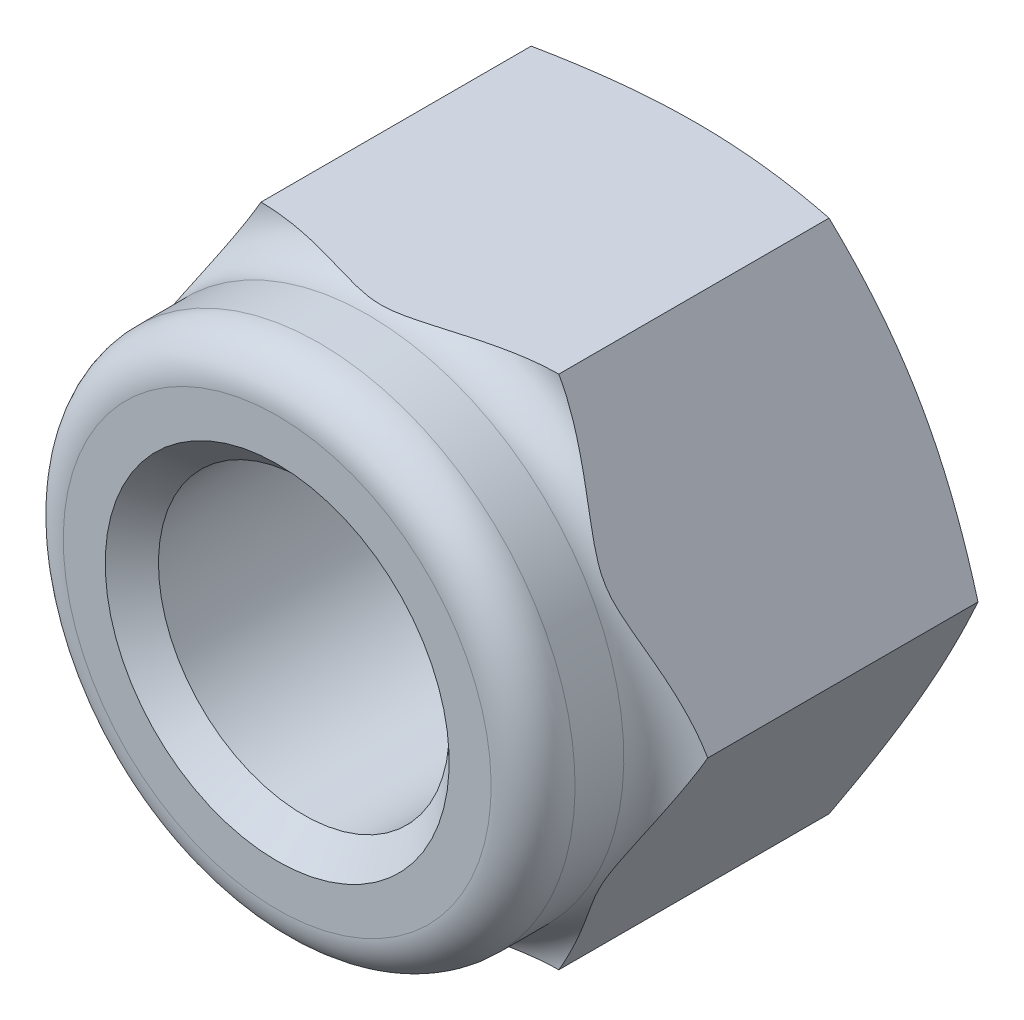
ISO-10303-21;
HEADER;
FILE_DESCRIPTION(('STEP AP214'),'2;1');
FILE_NAME('part.step','',(''),(''),'','','');
FILE_SCHEMA(('AUTOMOTIVE_DESIGN { 1 0 10303 214 1 1 1 1 }'));
ENDSEC;
DATA;
#1=APPLICATION_CONTEXT('core data for automotive mechanical design processes');
#2=APPLICATION_PROTOCOL_DEFINITION('international standard','automotive_design',2000,#1);
#3=PRODUCT_CONTEXT('',#1,'mechanical');
#4=PRODUCT('Part','Part','',(#3));
#5=PRODUCT_RELATED_PRODUCT_CATEGORY('part','',(#4));
#6=PRODUCT_DEFINITION_FORMATION('','',#4);
#7=PRODUCT_DEFINITION_CONTEXT('part definition',#1,'design');
#8=PRODUCT_DEFINITION('design','',#6,#7);
#9=PRODUCT_DEFINITION_SHAPE('','',#8);
#10=(LENGTH_UNIT() NAMED_UNIT(*) SI_UNIT(.MILLI.,.METRE.));
#11=(NAMED_UNIT(*) PLANE_ANGLE_UNIT() SI_UNIT($,.RADIAN.));
#12=(NAMED_UNIT(*) SI_UNIT($,.STERADIAN.) SOLID_ANGLE_UNIT());
#13=UNCERTAINTY_MEASURE_WITH_UNIT(LENGTH_MEASURE(1.E-05),#10,'distance_accuracy_value','');
#14=(GEOMETRIC_REPRESENTATION_CONTEXT(3) GLOBAL_UNCERTAINTY_ASSIGNED_CONTEXT((#13)) GLOBAL_UNIT_ASSIGNED_CONTEXT((#10,
#11,#12)) REPRESENTATION_CONTEXT('',''));
#15=CARTESIAN_POINT('',(0.,0.,0.));
#16=DIRECTION('',(0.,0.,1.));
#17=DIRECTION('',(1.,0.,0.));
#18=AXIS2_PLACEMENT_3D('',#15,#16,#17);
#19=CARTESIAN_POINT('',(0.,0.,0.));
#20=DIRECTION('',(0.,0.,1.));
#21=DIRECTION('',(0.,-1.,0.));
#22=AXIS2_PLACEMENT_3D('',#19,#20,#21);
#23=CONICAL_SURFACE('',#22,9.40175446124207,1.18682389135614);
#24=CARTESIAN_POINT('',(0.,0.,0.));
#25=DIRECTION('',(0.,0.,1.));
#26=DIRECTION('',(1.,0.,0.));
#27=AXIS2_PLACEMENT_3D('',#24,#25,#26);
#28=CIRCLE('',#27,9.40175446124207);
#29=CARTESIAN_POINT('',(9.40175446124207,0.,0.));
#30=VERTEX_POINT('',#29);
#31=EDGE_CURVE('E200',#30,#30,#28,.T.);
#32=ORIENTED_EDGE('',*,*,#31,.T.);
#33=EDGE_LOOP('',(#32));
#34=FACE_BOUND('',#33,.T.);
#35=CARTESIAN_POINT('',(6.06217488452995,10.4999953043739,1.10000004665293));
#36=CARTESIAN_POINT('',(6.27397090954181,10.1331538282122,1.01442397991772));
#37=CARTESIAN_POINT('',(6.48646598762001,9.76510155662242,0.935295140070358));
#38=CARTESIAN_POINT('',(6.91286124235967,9.02656331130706,0.792363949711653));
#39=CARTESIAN_POINT('',(7.12676216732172,8.65607604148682,0.728570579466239));
#40=CARTESIAN_POINT('',(7.55566465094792,7.91319514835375,0.61886443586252));
#41=CARTESIAN_POINT('',(7.77066586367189,7.54080212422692,0.572946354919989));
#42=CARTESIAN_POINT('',(8.20146693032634,6.79463278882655,0.501118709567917));
#43=CARTESIAN_POINT('',(8.41726659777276,6.42085680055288,0.475204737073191));
#44=CARTESIAN_POINT('',(8.84558069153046,5.67899502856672,0.444996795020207));
#45=CARTESIAN_POINT('',(9.05808868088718,5.31092039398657,0.440343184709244));
#46=CARTESIAN_POINT('',(9.48297907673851,4.57498864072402,0.451928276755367));
#47=CARTESIAN_POINT('',(9.6953614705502,4.20713154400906,0.468168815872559));
#48=CARTESIAN_POINT('',(10.1193592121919,3.47274591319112,0.520669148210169));
#49=CARTESIAN_POINT('',(10.3309749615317,3.10621668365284,0.556916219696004));
#50=CARTESIAN_POINT('',(10.7531961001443,2.37490821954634,0.647673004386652));
#51=CARTESIAN_POINT('',(10.9638015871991,2.01012881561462,0.70218091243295));
#52=CARTESIAN_POINT('',(11.2532321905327,1.5088203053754,0.788342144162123));
#53=CARTESIAN_POINT('',(11.3325846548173,1.37137780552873,0.813136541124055));
#54=CARTESIAN_POINT('',(11.4911022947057,1.0968171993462,0.864884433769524));
#55=CARTESIAN_POINT('',(11.5702674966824,0.959699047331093,0.891837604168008));
#56=CARTESIAN_POINT('',(11.7286881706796,0.68530639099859,0.947874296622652));
#57=CARTESIAN_POINT('',(11.8079430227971,0.548032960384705,0.976964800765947));
#58=CARTESIAN_POINT('',(11.9662790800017,0.273786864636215,1.03707084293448));
#59=CARTESIAN_POINT('',(12.0453602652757,0.136814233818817,1.06808658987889));
#60=CARTESIAN_POINT('',(12.12435011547,-1.9999999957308E-07,1.10000004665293));
#61=B_SPLINE_CURVE_WITH_KNOTS('',3,(#35,#36,#37,#38,#39,#40,#41,#42,#43,#44,#45,#46,#47,#48,#49,
#50,#51,#52,#53,#54,#55,#56,#57,#58,#59,#60),.UNSPECIFIED.,.F.,.F.,(4,2,2,2,2,2,2,2,2,2,2,2,4),
(0.,1.29654028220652,2.59383796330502,3.89075015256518,5.18737647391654,6.46198579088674,
7.7367071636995,9.01061890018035,10.2844047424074,10.766285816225,11.2480944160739,
11.7315536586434,12.2150654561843),.UNSPECIFIED.);
#62=CARTESIAN_POINT('',(6.062175,10.4999951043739,1.1));
#63=VERTEX_POINT('',#62);
#64=CARTESIAN_POINT('',(12.12435,0.,1.1));
#65=VERTEX_POINT('',#64);
#66=EDGE_CURVE('E42',#63,#65,#61,.T.);
#67=ORIENTED_EDGE('',*,*,#66,.T.);
#68=CARTESIAN_POINT('',(12.12435011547,1.99999999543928E-07,1.10000004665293));
#69=CARTESIAN_POINT('',(11.9125540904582,-0.366841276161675,1.01442397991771));
#70=CARTESIAN_POINT('',(11.70005901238,-0.734893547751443,0.935295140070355));
#71=CARTESIAN_POINT('',(11.2736637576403,-1.47343179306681,0.79236394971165));
#72=CARTESIAN_POINT('',(11.0597628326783,-1.84391906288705,0.728570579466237));
#73=CARTESIAN_POINT('',(10.6308603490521,-2.58679995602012,0.618864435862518));
#74=CARTESIAN_POINT('',(10.4158591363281,-2.95919298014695,0.572946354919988));
#75=CARTESIAN_POINT('',(9.98505806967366,-3.70536231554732,0.501118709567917));
#76=CARTESIAN_POINT('',(9.76925840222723,-4.079138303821,0.47520473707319));
#77=CARTESIAN_POINT('',(9.34094430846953,-4.82100007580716,0.444996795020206));
#78=CARTESIAN_POINT('',(9.12843631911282,-5.1890747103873,0.440343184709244));
#79=CARTESIAN_POINT('',(8.70354592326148,-5.92500646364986,0.451928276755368));
#80=CARTESIAN_POINT('',(8.49116352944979,-6.29286356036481,0.46816881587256));
#81=CARTESIAN_POINT('',(8.06716578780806,-7.02724919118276,0.520669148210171));
#82=CARTESIAN_POINT('',(7.85555003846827,-7.39377842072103,0.556916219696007));
#83=CARTESIAN_POINT('',(7.43332889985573,-8.12508688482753,0.647673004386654));
#84=CARTESIAN_POINT('',(7.22272341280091,-8.48986628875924,0.702180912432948));
#85=CARTESIAN_POINT('',(6.93329280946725,-8.99117479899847,0.788342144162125));
#86=CARTESIAN_POINT('',(6.85394034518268,-9.12861729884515,0.813136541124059));
#87=CARTESIAN_POINT('',(6.69542270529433,-9.40317790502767,0.864884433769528));
#88=CARTESIAN_POINT('',(6.61625750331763,-9.54029605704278,0.891837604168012));
#89=CARTESIAN_POINT('',(6.4578368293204,-9.81468871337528,0.947874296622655));
#90=CARTESIAN_POINT('',(6.37858197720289,-9.95196214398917,0.97696480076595));
#91=CARTESIAN_POINT('',(6.22024591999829,-10.2262082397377,1.03707084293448));
#92=CARTESIAN_POINT('',(6.14116473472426,-10.3631808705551,1.06808658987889));
#93=CARTESIAN_POINT('',(6.06217488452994,-10.4999953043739,1.10000004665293));
#94=B_SPLINE_CURVE_WITH_KNOTS('',3,(#68,#69,#70,#71,#72,#73,#74,#75,#76,#77,#78,#79,#80,#81,#82,
#83,#84,#85,#86,#87,#88,#89,#90,#91,#92,#93),.UNSPECIFIED.,.F.,.F.,(4,2,2,2,2,2,2,2,2,2,2,2,4),
(0.,1.29654028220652,2.59383796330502,3.89075015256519,5.18737647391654,6.46198579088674,
7.73670716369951,9.01061890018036,10.2844047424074,10.766285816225,11.2480944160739,
11.7315536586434,12.2150654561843),.UNSPECIFIED.);
#95=CARTESIAN_POINT('',(6.062175,-10.4999951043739,1.1));
#96=VERTEX_POINT('',#95);
#97=EDGE_CURVE('E35',#65,#96,#94,.T.);
#98=ORIENTED_EDGE('',*,*,#97,.T.);
#99=CARTESIAN_POINT('',(-16.0129370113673,-10.4999951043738,3.93793022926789));
#100=CARTESIAN_POINT('',(-15.5394466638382,-10.4999951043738,3.7779989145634));
#101=CARTESIAN_POINT('',(-15.0653256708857,-10.4999951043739,3.6199001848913));
#102=CARTESIAN_POINT('',(-14.1154961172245,-10.4999951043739,3.3083918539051));
#103=CARTESIAN_POINT('',(-13.6397874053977,-10.4999951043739,3.15498271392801));
#104=CARTESIAN_POINT('',(-12.6853941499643,-10.4999951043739,2.85354457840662));
#105=CARTESIAN_POINT('',(-12.2067051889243,-10.4999951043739,2.70552951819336));
#106=CARTESIAN_POINT('',(-11.2471632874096,-10.4999951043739,2.41670298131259));
#107=CARTESIAN_POINT('',(-10.7663103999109,-10.4999951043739,2.27589132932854));
#108=CARTESIAN_POINT('',(-9.80827286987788,-10.4999951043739,2.0050463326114));
#109=CARTESIAN_POINT('',(-9.33112111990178,-10.4999951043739,1.87489722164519));
#110=CARTESIAN_POINT('',(-8.37391347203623,-10.4999951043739,1.62561388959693));
#111=CARTESIAN_POINT('',(-7.89385748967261,-10.4999951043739,1.50647999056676));
#112=CARTESIAN_POINT('',(-6.93077488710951,-10.4999951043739,1.28207856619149));
#113=CARTESIAN_POINT('',(-6.44775010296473,-10.4999951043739,1.17680322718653));
#114=CARTESIAN_POINT('',(-5.47826816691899,-10.4999951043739,0.983377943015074));
#115=CARTESIAN_POINT('',(-4.99181126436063,-10.4999951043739,0.895226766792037));
#116=CARTESIAN_POINT('',(-4.11540750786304,-10.4999951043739,0.755650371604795));
#117=CARTESIAN_POINT('',(-3.72607276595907,-10.4999951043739,0.700401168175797));
#118=CARTESIAN_POINT('',(-2.9455518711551,-10.4999951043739,0.604921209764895));
#119=CARTESIAN_POINT('',(-2.55436576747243,-10.4999951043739,0.564690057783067));
#120=CARTESIAN_POINT('',(-1.77087691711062,-10.4999951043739,0.50083912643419));
#121=CARTESIAN_POINT('',(-1.37857505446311,-10.4999951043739,0.477208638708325));
#122=CARTESIAN_POINT('',(-0.593299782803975,-10.4999951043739,0.447549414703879));
#123=CARTESIAN_POINT('',(-0.200326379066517,-10.4999951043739,0.441520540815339));
#124=CARTESIAN_POINT('',(0.587392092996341,-10.4999951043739,0.447356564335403));
#125=CARTESIAN_POINT('',(0.982136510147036,-10.4999951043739,0.459308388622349));
#126=CARTESIAN_POINT('',(1.77069910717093,-10.4999951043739,0.500716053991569));
#127=CARTESIAN_POINT('',(2.16451727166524,-10.4999951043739,0.530172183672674));
#128=CARTESIAN_POINT('',(2.9508312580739,-10.4999951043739,0.605352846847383));
#129=CARTESIAN_POINT('',(3.34332607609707,-10.4999951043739,0.651087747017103));
#130=CARTESIAN_POINT('',(4.12632096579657,-10.4999951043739,0.757103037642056));
#131=CARTESIAN_POINT('',(4.5168210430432,-10.4999951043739,0.81738338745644));
#132=CARTESIAN_POINT('',(5.36094871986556,-10.4999951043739,0.961755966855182));
#133=CARTESIAN_POINT('',(5.81418072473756,-10.4999951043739,1.04814616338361));
#134=CARTESIAN_POINT('',(6.71771031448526,-10.4999951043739,1.2352115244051));
#135=CARTESIAN_POINT('',(7.16800752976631,-10.4999951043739,1.33588845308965));
#136=CARTESIAN_POINT('',(8.06604172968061,-10.4999951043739,1.5489381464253));
#137=CARTESIAN_POINT('',(8.51377733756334,-10.4999951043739,1.66131667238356));
#138=CARTESIAN_POINT('',(9.40674072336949,-10.4999951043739,1.89551075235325));
#139=CARTESIAN_POINT('',(9.85196859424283,-10.4999951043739,2.01732595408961));
#140=CARTESIAN_POINT('',(10.741418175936,-10.4999951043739,2.26892979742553));
#141=CARTESIAN_POINT('',(11.1856341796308,-10.4999951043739,2.39873852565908));
#142=CARTESIAN_POINT('',(12.0721919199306,-10.4999951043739,2.66459513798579));
#143=CARTESIAN_POINT('',(12.5145336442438,-10.4999951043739,2.80064306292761));
#144=CARTESIAN_POINT('',(13.3974946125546,-10.4999951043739,3.07779461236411));
#145=CARTESIAN_POINT('',(13.8381142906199,-10.4999951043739,3.21889685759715));
#146=CARTESIAN_POINT('',(14.7179871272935,-10.4999951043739,3.50528609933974));
#147=CARTESIAN_POINT('',(15.1572402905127,-10.4999951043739,3.65057308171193));
#148=CARTESIAN_POINT('',(16.0316057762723,-10.4999951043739,3.94361471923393));
#149=CARTESIAN_POINT('',(16.4667259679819,-10.4999951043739,4.09134593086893));
#150=CARTESIAN_POINT('',(17.3359851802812,-10.4999951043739,4.38966974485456));
#151=CARTESIAN_POINT('',(17.7701241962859,-10.4999951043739,4.54026236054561));
#152=CARTESIAN_POINT('',(19.0713434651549,-10.4999951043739,4.99565223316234));
#153=CARTESIAN_POINT('',(19.9371665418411,-10.4999951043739,5.30404146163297));
#154=CARTESIAN_POINT('',(21.6605967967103,-10.4999951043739,5.92566137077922));
#155=CARTESIAN_POINT('',(22.5182204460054,-10.4999951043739,6.23884655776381));
#156=CARTESIAN_POINT('',(23.8031903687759,-10.4999951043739,6.71242701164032));
#157=CARTESIAN_POINT('',(24.2312425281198,-10.4999951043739,6.87091084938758));
#158=CARTESIAN_POINT('',(25.0869295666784,-10.4999951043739,7.18899648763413));
#159=CARTESIAN_POINT('',(25.5145644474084,-10.4999951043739,7.34859828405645));
#160=CARTESIAN_POINT('',(25.9420188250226,-10.4999951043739,7.50868169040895));
#161=B_SPLINE_CURVE_WITH_KNOTS('',3,(#99,#100,#101,#102,#103,#104,#105,#106,#107,#108,#109,#110,
#111,#112,#113,#114,#115,#116,#117,#118,#119,#120,#121,#122,#123,#124,#125,#126,#127,#128,#129,
#130,#131,#132,#133,#134,#135,#136,#137,#138,#139,#140,#141,#142,#143,#144,#145,#146,#147,#148,
#149,#150,#151,#152,#153,#154,#155,#156,#157,#158,#159,#160),.UNSPECIFIED.,.F.,.F.,(4,2,2,2,2,2,
2,2,2,2,2,2,2,2,2,2,2,2,2,2,2,2,2,2,2,2,2,2,2,2,4),(0.,1.49932603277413,2.99879908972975,
4.50190502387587,6.00497435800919,7.48862073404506,8.97231047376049,10.4551600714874,
11.937903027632,13.1173575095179,14.2967808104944,15.47544261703,16.6540952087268,
17.8384642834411,19.0228528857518,20.2079970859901,21.3931379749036,22.7770258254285,
24.1610847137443,25.545828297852,26.9305202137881,28.3188461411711,29.7071811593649,
31.095140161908,32.4830944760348,33.8616278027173,35.240167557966,37.9974351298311,
40.7364717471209,42.1058177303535,43.4751587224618),.UNSPECIFIED.);
#162=CARTESIAN_POINT('',(-6.062175,-10.4999951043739,1.1));
#163=VERTEX_POINT('',#162);
#164=EDGE_CURVE('E80',#96,#163,#161,.F.);
#165=ORIENTED_EDGE('',*,*,#164,.T.);
#166=CARTESIAN_POINT('',(-6.06217488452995,-10.4999953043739,1.10000004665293));
#167=CARTESIAN_POINT('',(-6.27397090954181,-10.1331538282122,1.01442397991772));
#168=CARTESIAN_POINT('',(-6.48646598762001,-9.76510155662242,0.935295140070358));
#169=CARTESIAN_POINT('',(-6.91286124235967,-9.02656331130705,0.792363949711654));
#170=CARTESIAN_POINT('',(-7.12676216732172,-8.65607604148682,0.728570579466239));
#171=CARTESIAN_POINT('',(-7.55566465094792,-7.91319514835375,0.618864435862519));
#172=CARTESIAN_POINT('',(-7.77066586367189,-7.54080212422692,0.572946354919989));
#173=CARTESIAN_POINT('',(-8.20146693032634,-6.79463278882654,0.501118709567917));
#174=CARTESIAN_POINT('',(-8.41726659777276,-6.42085680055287,0.47520473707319));
#175=CARTESIAN_POINT('',(-8.84558069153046,-5.67899502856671,0.444996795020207));
#176=CARTESIAN_POINT('',(-9.05808868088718,-5.31092039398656,0.440343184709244));
#177=CARTESIAN_POINT('',(-9.48297907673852,-4.57498864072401,0.451928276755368));
#178=CARTESIAN_POINT('',(-9.69536147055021,-4.20713154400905,0.46816881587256));
#179=CARTESIAN_POINT('',(-10.1193592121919,-3.4727459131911,0.520669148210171));
#180=CARTESIAN_POINT('',(-10.3309749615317,-3.10621668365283,0.556916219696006));
#181=CARTESIAN_POINT('',(-10.7531961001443,-2.37490821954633,0.647673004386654));
#182=CARTESIAN_POINT('',(-10.9638015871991,-2.01012881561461,0.70218091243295));
#183=CARTESIAN_POINT('',(-11.2532321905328,-1.50882030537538,0.788342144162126));
#184=CARTESIAN_POINT('',(-11.3325846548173,-1.37137780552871,0.813136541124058));
#185=CARTESIAN_POINT('',(-11.4911022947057,-1.09681719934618,0.864884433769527));
#186=CARTESIAN_POINT('',(-11.5702674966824,-0.959699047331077,0.891837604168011));
#187=CARTESIAN_POINT('',(-11.7286881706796,-0.685306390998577,0.947874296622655));
#188=CARTESIAN_POINT('',(-11.8079430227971,-0.548032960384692,0.976964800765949));
#189=CARTESIAN_POINT('',(-11.9662790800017,-0.273786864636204,1.03707084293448));
#190=CARTESIAN_POINT('',(-12.0453602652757,-0.136814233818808,1.06808658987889));
#191=CARTESIAN_POINT('',(-12.1243501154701,2.00000002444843E-07,1.10000004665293));
#192=B_SPLINE_CURVE_WITH_KNOTS('',3,(#166,#167,#168,#169,#170,#171,#172,#173,#174,#175,#176,
#177,#178,#179,#180,#181,#182,#183,#184,#185,#186,#187,#188,#189,#190,#191),.UNSPECIFIED.,.F.,
.F.,(4,2,2,2,2,2,2,2,2,2,2,2,4),(0.,1.29654028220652,2.59383796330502,3.89075015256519,
5.18737647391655,6.46198579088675,7.73670716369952,9.01061890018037,10.2844047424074,
10.766285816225,11.2480944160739,11.7315536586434,12.2150654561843),.UNSPECIFIED.);
#193=CARTESIAN_POINT('',(-12.12435,0.,1.1));
#194=VERTEX_POINT('',#193);
#195=EDGE_CURVE('E88',#163,#194,#192,.T.);
#196=ORIENTED_EDGE('',*,*,#195,.T.);
#197=CARTESIAN_POINT('',(-12.12435011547,-1.99999997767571E-07,1.10000004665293));
#198=CARTESIAN_POINT('',(-11.9125540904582,0.366841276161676,1.01442397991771));
#199=CARTESIAN_POINT('',(-11.70005901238,0.734893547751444,0.935295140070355));
#200=CARTESIAN_POINT('',(-11.2736637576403,1.47343179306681,0.79236394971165));
#201=CARTESIAN_POINT('',(-11.0597628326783,1.84391906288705,0.728570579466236));
#202=CARTESIAN_POINT('',(-10.6308603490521,2.58679995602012,0.618864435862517));
#203=CARTESIAN_POINT('',(-10.4158591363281,2.95919298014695,0.572946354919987));
#204=CARTESIAN_POINT('',(-9.98505806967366,3.70536231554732,0.501118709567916));
#205=CARTESIAN_POINT('',(-9.76925840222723,4.079138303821,0.475204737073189));
#206=CARTESIAN_POINT('',(-9.34094430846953,4.82100007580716,0.444996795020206));
#207=CARTESIAN_POINT('',(-9.12843631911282,5.1890747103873,0.440343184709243));
#208=CARTESIAN_POINT('',(-8.70354592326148,5.92500646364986,0.451928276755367));
#209=CARTESIAN_POINT('',(-8.49116352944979,6.29286356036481,0.468168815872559));
#210=CARTESIAN_POINT('',(-8.06716578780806,7.02724919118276,0.52066914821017));
#211=CARTESIAN_POINT('',(-7.85555003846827,7.39377842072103,0.556916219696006));
#212=CARTESIAN_POINT('',(-7.43332889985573,8.12508688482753,0.647673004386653));
#213=CARTESIAN_POINT('',(-7.22272341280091,8.48986628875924,0.702180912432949));
#214=CARTESIAN_POINT('',(-6.93329280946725,8.99117479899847,0.788342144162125));
#215=CARTESIAN_POINT('',(-6.85394034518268,9.12861729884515,0.813136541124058));
#216=CARTESIAN_POINT('',(-6.69542270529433,9.40317790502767,0.864884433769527));
#217=CARTESIAN_POINT('',(-6.61625750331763,9.54029605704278,0.891837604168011));
#218=CARTESIAN_POINT('',(-6.4578368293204,9.81468871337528,0.947874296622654));
#219=CARTESIAN_POINT('',(-6.37858197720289,9.95196214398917,0.976964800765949));
#220=CARTESIAN_POINT('',(-6.2202459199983,10.2262082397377,1.03707084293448));
#221=CARTESIAN_POINT('',(-6.14116473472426,10.3631808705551,1.06808658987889));
#222=CARTESIAN_POINT('',(-6.06217488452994,10.4999953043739,1.10000004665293));
#223=B_SPLINE_CURVE_WITH_KNOTS('',3,(#197,#198,#199,#200,#201,#202,#203,#204,#205,#206,#207,
#208,#209,#210,#211,#212,#213,#214,#215,#216,#217,#218,#219,#220,#221,#222),.UNSPECIFIED.,.F.,
.F.,(4,2,2,2,2,2,2,2,2,2,2,2,4),(0.,1.29654028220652,2.59383796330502,3.89075015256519,
5.18737647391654,6.46198579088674,7.73670716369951,9.01061890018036,10.2844047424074,
10.766285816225,11.2480944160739,11.7315536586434,12.2150654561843),.UNSPECIFIED.);
#224=CARTESIAN_POINT('',(-6.062175,10.4999951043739,1.1));
#225=VERTEX_POINT('',#224);
#226=EDGE_CURVE('E93',#194,#225,#223,.T.);
#227=ORIENTED_EDGE('',*,*,#226,.T.);
#228=CARTESIAN_POINT('',(-16.0129370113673,10.4999951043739,3.93793022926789));
#229=CARTESIAN_POINT('',(-15.5394466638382,10.4999951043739,3.7779989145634));
#230=CARTESIAN_POINT('',(-15.0653256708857,10.4999951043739,3.61990018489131));
#231=CARTESIAN_POINT('',(-14.1154961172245,10.4999951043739,3.3083918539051));
#232=CARTESIAN_POINT('',(-13.6397874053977,10.4999951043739,3.15498271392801));
#233=CARTESIAN_POINT('',(-12.6853941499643,10.4999951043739,2.85354457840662));
#234=CARTESIAN_POINT('',(-12.2067051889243,10.4999951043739,2.70552951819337));
#235=CARTESIAN_POINT('',(-11.2471632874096,10.4999951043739,2.41670298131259));
#236=CARTESIAN_POINT('',(-10.7663103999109,10.4999951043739,2.27589132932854));
#237=CARTESIAN_POINT('',(-9.80827286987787,10.4999951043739,2.0050463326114));
#238=CARTESIAN_POINT('',(-9.33112111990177,10.4999951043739,1.87489722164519));
#239=CARTESIAN_POINT('',(-8.37391347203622,10.4999951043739,1.62561388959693));
#240=CARTESIAN_POINT('',(-7.8938574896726,10.4999951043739,1.50647999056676));
#241=CARTESIAN_POINT('',(-6.9307748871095,10.4999951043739,1.28207856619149));
#242=CARTESIAN_POINT('',(-6.44775010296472,10.4999951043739,1.17680322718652));
#243=CARTESIAN_POINT('',(-5.47826816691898,10.4999951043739,0.983377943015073));
#244=CARTESIAN_POINT('',(-4.99181126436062,10.4999951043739,0.895226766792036));
#245=CARTESIAN_POINT('',(-4.11540750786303,10.4999951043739,0.755650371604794));
#246=CARTESIAN_POINT('',(-3.72607276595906,10.4999951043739,0.700401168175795));
#247=CARTESIAN_POINT('',(-2.94555187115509,10.4999951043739,0.604921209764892));
#248=CARTESIAN_POINT('',(-2.55436576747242,10.4999951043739,0.564690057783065));
#249=CARTESIAN_POINT('',(-1.77087691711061,10.4999951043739,0.500839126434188));
#250=CARTESIAN_POINT('',(-1.3785750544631,10.4999951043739,0.477208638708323));
#251=CARTESIAN_POINT('',(-0.593299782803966,10.4999951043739,0.447549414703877));
#252=CARTESIAN_POINT('',(-0.200326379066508,10.4999951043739,0.441520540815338));
#253=CARTESIAN_POINT('',(0.587392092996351,10.4999951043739,0.447356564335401));
#254=CARTESIAN_POINT('',(0.982136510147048,10.4999951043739,0.459308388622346));
#255=CARTESIAN_POINT('',(1.77069910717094,10.4999951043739,0.500716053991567));
#256=CARTESIAN_POINT('',(2.16451727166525,10.4999951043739,0.530172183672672));
#257=CARTESIAN_POINT('',(2.95083125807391,10.4999951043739,0.605352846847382));
#258=CARTESIAN_POINT('',(3.34332607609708,10.4999951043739,0.651087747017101));
#259=CARTESIAN_POINT('',(4.12632096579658,10.4999951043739,0.757103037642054));
#260=CARTESIAN_POINT('',(4.51682104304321,10.4999951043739,0.81738338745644));
#261=CARTESIAN_POINT('',(5.36094871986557,10.4999951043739,0.961755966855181));
#262=CARTESIAN_POINT('',(5.81418072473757,10.4999951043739,1.0481461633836));
#263=CARTESIAN_POINT('',(6.71771031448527,10.4999951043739,1.23521152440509));
#264=CARTESIAN_POINT('',(7.16800752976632,10.4999951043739,1.33588845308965));
#265=CARTESIAN_POINT('',(8.06604172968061,10.4999951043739,1.5489381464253));
#266=CARTESIAN_POINT('',(8.51377733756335,10.4999951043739,1.66131667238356));
#267=CARTESIAN_POINT('',(9.40674072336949,10.4999951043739,1.89551075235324));
#268=CARTESIAN_POINT('',(9.85196859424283,10.4999951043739,2.01732595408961));
#269=CARTESIAN_POINT('',(10.7414181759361,10.4999951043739,2.26892979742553));
#270=CARTESIAN_POINT('',(11.1856341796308,10.4999951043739,2.39873852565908));
#271=CARTESIAN_POINT('',(12.0721919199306,10.4999951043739,2.66459513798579));
#272=CARTESIAN_POINT('',(12.5145336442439,10.4999951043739,2.80064306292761));
#273=CARTESIAN_POINT('',(13.3974946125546,10.4999951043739,3.07779461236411));
#274=CARTESIAN_POINT('',(13.8381142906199,10.4999951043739,3.21889685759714));
#275=CARTESIAN_POINT('',(14.7179871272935,10.4999951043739,3.50528609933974));
#276=CARTESIAN_POINT('',(15.1572402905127,10.4999951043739,3.65057308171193));
#277=CARTESIAN_POINT('',(16.0316057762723,10.4999951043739,3.94361471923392));
#278=CARTESIAN_POINT('',(16.4667259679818,10.4999951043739,4.09134593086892));
#279=CARTESIAN_POINT('',(17.3359851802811,10.4999951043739,4.38966974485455));
#280=CARTESIAN_POINT('',(17.7701241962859,10.4999951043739,4.54026236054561));
#281=CARTESIAN_POINT('',(19.0713434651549,10.4999951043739,4.99565223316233));
#282=CARTESIAN_POINT('',(19.9371665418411,10.4999951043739,5.30404146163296));
#283=CARTESIAN_POINT('',(21.6605967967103,10.4999951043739,5.92566137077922));
#284=CARTESIAN_POINT('',(22.5182204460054,10.4999951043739,6.23884655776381));
#285=CARTESIAN_POINT('',(23.8031903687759,10.4999951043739,6.71242701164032));
#286=CARTESIAN_POINT('',(24.2312425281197,10.4999951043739,6.87091084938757));
#287=CARTESIAN_POINT('',(25.0869295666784,10.4999951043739,7.18899648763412));
#288=CARTESIAN_POINT('',(25.5145644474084,10.4999951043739,7.34859828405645));
#289=CARTESIAN_POINT('',(25.9420188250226,10.4999951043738,7.50868169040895));
#290=B_SPLINE_CURVE_WITH_KNOTS('',3,(#228,#229,#230,#231,#232,#233,#234,#235,#236,#237,#238,
#239,#240,#241,#242,#243,#244,#245,#246,#247,#248,#249,#250,#251,#252,#253,#254,#255,#256,#257,
#258,#259,#260,#261,#262,#263,#264,#265,#266,#267,#268,#269,#270,#271,#272,#273,#274,#275,#276,
#277,#278,#279,#280,#281,#282,#283,#284,#285,#286,#287,#288,#289),.UNSPECIFIED.,.F.,.F.,(4,2,2,
2,2,2,2,2,2,2,2,2,2,2,2,2,2,2,2,2,2,2,2,2,2,2,2,2,2,2,4),(0.,1.49932603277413,2.99879908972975,
4.50190502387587,6.00497435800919,7.48862073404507,8.9723104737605,10.4551600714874,
11.937903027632,13.1173575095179,14.2967808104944,15.4754426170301,16.6540952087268,
17.8384642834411,19.0228528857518,20.2079970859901,21.3931379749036,22.7770258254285,
24.1610847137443,25.545828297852,26.9305202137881,28.3188461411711,29.7071811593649,
31.095140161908,32.4830944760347,33.8616278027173,35.240167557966,37.9974351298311,
40.7364717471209,42.1058177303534,43.4751587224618),.UNSPECIFIED.);
#291=EDGE_CURVE('E178',#225,#63,#290,.T.);
#292=ORIENTED_EDGE('',*,*,#291,.T.);
#293=EDGE_LOOP('',(#67,#98,#165,#196,#227,#292));
#294=FACE_BOUND('',#293,.T.);
#295=ADVANCED_FACE('F15',(#34,#294),#23,.T.);
#296=CARTESIAN_POINT('',(12.12435,0.,0.));
#297=DIRECTION('',(0.,0.,1.));
#298=DIRECTION('',(1.,0.,0.));
#299=AXIS2_PLACEMENT_3D('',#296,#297,#298);
#300=PLANE('',#299);
#301=CARTESIAN_POINT('',(0.,0.,0.));
#302=DIRECTION('',(0.,0.,1.));
#303=DIRECTION('',(1.,0.,0.));
#304=AXIS2_PLACEMENT_3D('',#301,#302,#303);
#305=CIRCLE('',#304,7.);
#306=CARTESIAN_POINT('',(7.,0.,0.));
#307=VERTEX_POINT('',#306);
#308=EDGE_CURVE('E203',#307,#307,#305,.F.);
#309=ORIENTED_EDGE('',*,*,#308,.F.);
#310=EDGE_LOOP('',(#309));
#311=FACE_BOUND('',#310,.T.);
#312=ORIENTED_EDGE('',*,*,#31,.F.);
#313=EDGE_LOOP('',(#312));
#314=FACE_BOUND('',#313,.T.);
#315=ADVANCED_FACE('F223',(#311,#314),#300,.F.);
#316=CARTESIAN_POINT('',(0.,0.,17.5));
#317=DIRECTION('',(0.,0.,1.));
#318=DIRECTION('',(0.,-1.,0.));
#319=AXIS2_PLACEMENT_3D('',#316,#317,#318);
#320=CONICAL_SURFACE('',#319,7.,0.785398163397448);
#321=CARTESIAN_POINT('',(0.,0.,16.4175));
#322=DIRECTION('',(0.,0.,-1.));
#323=DIRECTION('',(0.,1.,0.));
#324=AXIS2_PLACEMENT_3D('',#321,#322,#323);
#325=CIRCLE('',#324,5.9175);
#326=CARTESIAN_POINT('',(0.,5.9175,16.4175));
#327=VERTEX_POINT('',#326);
#328=EDGE_CURVE('E245',#327,#327,#325,.T.);
#329=ORIENTED_EDGE('',*,*,#328,.T.);
#330=EDGE_LOOP('',(#329));
#331=FACE_BOUND('',#330,.T.);
#332=CARTESIAN_POINT('',(0.,0.,17.5));
#333=DIRECTION('',(0.,0.,-1.));
#334=DIRECTION('',(0.,1.,0.));
#335=AXIS2_PLACEMENT_3D('',#332,#333,#334);
#336=CIRCLE('',#335,7.);
#337=CARTESIAN_POINT('',(0.,7.,17.5));
#338=VERTEX_POINT('',#337);
#339=EDGE_CURVE('E248',#338,#338,#336,.T.);
#340=ORIENTED_EDGE('',*,*,#339,.F.);
#341=EDGE_LOOP('',(#340));
#342=FACE_BOUND('',#341,.T.);
#343=ADVANCED_FACE('F229',(#331,#342),#320,.F.);
#344=CARTESIAN_POINT('',(0.,0.,0.));
#345=DIRECTION('',(0.,0.,-1.));
#346=DIRECTION('',(0.,1.,0.));
#347=AXIS2_PLACEMENT_3D('',#344,#345,#346);
#348=CYLINDRICAL_SURFACE('',#347,5.9175);
#349=CARTESIAN_POINT('',(0.,0.,1.0825));
#350=DIRECTION('',(0.,0.,-1.));
#351=DIRECTION('',(0.,1.,0.));
#352=AXIS2_PLACEMENT_3D('',#349,#350,#351);
#353=CIRCLE('',#352,5.9175);
#354=CARTESIAN_POINT('',(0.,5.9175,1.0825));
#355=VERTEX_POINT('',#354);
#356=EDGE_CURVE('E243',#355,#355,#353,.T.);
#357=ORIENTED_EDGE('',*,*,#356,.T.);
#358=EDGE_LOOP('',(#357));
#359=FACE_BOUND('',#358,.T.);
#360=ORIENTED_EDGE('',*,*,#328,.F.);
#361=EDGE_LOOP('',(#360));
#362=FACE_BOUND('',#361,.T.);
#363=ADVANCED_FACE('F219',(#359,#362),#348,.F.);
#364=CARTESIAN_POINT('',(0.,0.,1.0825));
#365=DIRECTION('',(0.,0.,-1.));
#366=DIRECTION('',(0.,1.,0.));
#367=AXIS2_PLACEMENT_3D('',#364,#365,#366);
#368=CONICAL_SURFACE('',#367,5.9175,0.785398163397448);
#369=ORIENTED_EDGE('',*,*,#308,.T.);
#370=EDGE_LOOP('',(#369));
#371=FACE_BOUND('',#370,.T.);
#372=ORIENTED_EDGE('',*,*,#356,.F.);
#373=EDGE_LOOP('',(#372));
#374=FACE_BOUND('',#373,.T.);
#375=ADVANCED_FACE('F212',(#371,#374),#368,.F.);
#376=CARTESIAN_POINT('',(12.12435,0.,17.5));
#377=DIRECTION('',(0.,0.,1.));
#378=DIRECTION('',(1.,0.,0.));
#379=AXIS2_PLACEMENT_3D('',#376,#377,#378);
#380=PLANE('',#379);
#381=ORIENTED_EDGE('',*,*,#339,.T.);
#382=EDGE_LOOP('',(#381));
#383=FACE_BOUND('',#382,.T.);
#384=CARTESIAN_POINT('',(0.,0.,17.5));
#385=DIRECTION('',(0.,0.,-1.));
#386=DIRECTION('',(0.,1.,0.));
#387=AXIS2_PLACEMENT_3D('',#384,#385,#386);
#388=CIRCLE('',#387,8.70811666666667);
#389=CARTESIAN_POINT('',(0.,8.70811666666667,17.5));
#390=VERTEX_POINT('',#389);
#391=EDGE_CURVE('E28',#390,#390,#388,.T.);
#392=ORIENTED_EDGE('',*,*,#391,.F.);
#393=EDGE_LOOP('',(#392));
#394=FACE_BOUND('',#393,.T.);
#395=ADVANCED_FACE('F115',(#383,#394),#380,.T.);
#396=CARTESIAN_POINT('',(0.,0.,13.8081166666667));
#397=DIRECTION('',(0.,0.,-1.));
#398=DIRECTION('',(0.,1.,0.));
#399=AXIS2_PLACEMENT_3D('',#396,#397,#398);
#400=TOROIDAL_SURFACE('',#399,12.12435,1.70811666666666);
#401=CARTESIAN_POINT('',(0.,0.,13.8081166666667));
#402=DIRECTION('',(0.,0.,-1.));
#403=DIRECTION('',(0.,1.,0.));
#404=AXIS2_PLACEMENT_3D('',#401,#402,#403);
#405=CIRCLE('',#404,10.4162333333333);
#406=CARTESIAN_POINT('',(0.,10.4162333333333,13.8081166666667));
#407=VERTEX_POINT('',#406);
#408=EDGE_CURVE('E95',#407,#407,#405,.T.);
#409=ORIENTED_EDGE('',*,*,#408,.T.);
#410=EDGE_LOOP('',(#409));
#411=FACE_BOUND('',#410,.T.);
#412=CARTESIAN_POINT('',(12.12435011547,2.E-07,12.1));
#413=CARTESIAN_POINT('',(12.0599929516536,-0.111469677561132,12.1000236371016));
#414=CARTESIAN_POINT('',(11.9956597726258,-0.222898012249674,12.1036355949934));
#415=CARTESIAN_POINT('',(11.8671997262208,-0.445397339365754,12.1171729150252));
#416=CARTESIAN_POINT('',(11.8030727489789,-0.556468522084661,12.1270940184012));
#417=CARTESIAN_POINT('',(11.6752929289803,-0.777789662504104,12.152349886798));
#418=CARTESIAN_POINT('',(11.6116392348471,-0.888041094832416,12.1676679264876));
#419=CARTESIAN_POINT('',(11.4846510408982,-1.10799109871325,12.2030125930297));
#420=CARTESIAN_POINT('',(11.4213166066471,-1.2176895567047,12.223040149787));
#421=CARTESIAN_POINT('',(11.2314291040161,-1.54658435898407,12.2893429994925));
#422=CARTESIAN_POINT('',(11.1054104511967,-1.76485506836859,12.3417471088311));
#423=CARTESIAN_POINT('',(10.8547402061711,-2.19902866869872,12.458181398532));
#424=CARTESIAN_POINT('',(10.7300889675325,-2.41493094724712,12.5222145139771));
#425=CARTESIAN_POINT('',(10.505254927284,-2.80435492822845,12.6445479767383));
#426=CARTESIAN_POINT('',(10.4049044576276,-2.97816704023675,12.7016410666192));
#427=CARTESIAN_POINT('',(10.2044370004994,-3.32538686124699,12.8176090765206));
#428=CARTESIAN_POINT('',(10.1043200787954,-3.49879445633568,12.8764844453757));
#429=CARTESIAN_POINT('',(9.9548392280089,-3.75770288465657,12.9622543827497));
#430=CARTESIAN_POINT('',(9.90562094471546,-3.84295145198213,12.9901515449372));
#431=CARTESIAN_POINT('',(9.80698398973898,-4.01379566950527,13.0444810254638));
#432=CARTESIAN_POINT('',(9.7575653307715,-4.09939129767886,13.0709134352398));
#433=CARTESIAN_POINT('',(9.65840963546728,-4.27113399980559,13.1212002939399));
#434=CARTESIAN_POINT('',(9.60867269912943,-4.35728090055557,13.1450555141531));
#435=CARTESIAN_POINT('',(9.50875437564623,-4.53034451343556,13.1886251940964));
#436=CARTESIAN_POINT('',(9.4585731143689,-4.61726100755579,13.2083407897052));
#437=CARTESIAN_POINT('',(9.34315159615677,-4.81717694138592,13.2463681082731));
#438=CARTESIAN_POINT('',(9.27772974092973,-4.93049091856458,13.2626465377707));
#439=CARTESIAN_POINT('',(9.14647956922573,-5.15782288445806,13.2805258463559));
#440=CARTESIAN_POINT('',(9.08065244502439,-5.27183880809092,13.2821585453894));
#441=CARTESIAN_POINT('',(8.94831476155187,-5.50105439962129,13.2701723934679));
#442=CARTESIAN_POINT('',(8.88181026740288,-5.61624356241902,13.2563075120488));
#443=CARTESIAN_POINT('',(8.78266172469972,-5.7879738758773,13.2268468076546));
#444=CARTESIAN_POINT('',(8.74966109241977,-5.84513264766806,13.2155575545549));
#445=CARTESIAN_POINT('',(8.68387476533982,-5.95907790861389,13.1907035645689));
#446=CARTESIAN_POINT('',(8.65108905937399,-6.01586441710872,13.1771389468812));
#447=CARTESIAN_POINT('',(8.56341804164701,-6.16771507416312,13.1384434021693));
#448=CARTESIAN_POINT('',(8.50870975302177,-6.26247260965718,13.111733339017));
#449=CARTESIAN_POINT('',(8.39965812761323,-6.45135556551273,13.0554605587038));
#450=CARTESIAN_POINT('',(8.34531487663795,-6.5454808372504,13.0258971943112));
#451=CARTESIAN_POINT('',(8.23680501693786,-6.73342542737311,12.9652811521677));
#452=CARTESIAN_POINT('',(8.1826385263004,-6.8272445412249,12.9342276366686));
#453=CARTESIAN_POINT('',(8.07438027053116,-7.01475334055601,12.8716017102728));
#454=CARTESIAN_POINT('',(8.02028850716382,-7.10844302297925,12.8400292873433));
#455=CARTESIAN_POINT('',(7.85816078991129,-7.38925646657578,12.7457304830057));
#456=CARTESIAN_POINT('',(7.75007914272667,-7.57645937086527,12.6833085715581));
#457=CARTESIAN_POINT('',(7.53325543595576,-7.95200904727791,12.563276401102));
#458=CARTESIAN_POINT('',(7.42451349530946,-8.14035561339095,12.5056653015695));
#459=CARTESIAN_POINT('',(7.21328072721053,-8.5062214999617,12.4018835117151));
#460=CARTESIAN_POINT('',(7.1108527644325,-8.68363193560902,12.355207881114));
#461=CARTESIAN_POINT('',(6.90506463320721,-9.04006743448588,12.2712164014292));
#462=CARTESIAN_POINT('',(6.80170493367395,-9.21909168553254,12.2338960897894));
#463=CARTESIAN_POINT('',(6.64534431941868,-9.48991621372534,12.1867559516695));
#464=CARTESIAN_POINT('',(6.59267890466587,-9.5811353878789,12.172456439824));
#465=CARTESIAN_POINT('',(6.48714406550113,-9.76392709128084,12.1473430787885));
#466=CARTESIAN_POINT('',(6.43427466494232,-9.85549957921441,12.1365288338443));
#467=CARTESIAN_POINT('',(6.32826151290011,-10.039119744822,12.118795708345));
#468=CARTESIAN_POINT('',(6.27511742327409,-10.1311680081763,12.1118847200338));
#469=CARTESIAN_POINT('',(6.16871117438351,-10.3154690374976,12.1024917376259));
#470=CARTESIAN_POINT('',(6.11544897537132,-10.4077218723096,12.1000115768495));
#471=CARTESIAN_POINT('',(6.06217488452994,-10.4999953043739,12.1));
#472=B_SPLINE_CURVE_WITH_KNOTS('',3,(#412,#413,#414,#415,#416,#417,#418,#419,#420,#421,#422,
#423,#424,#425,#426,#427,#428,#429,#430,#431,#432,#433,#434,#435,#436,#437,#438,#439,#440,#441,
#442,#443,#444,#445,#446,#447,#448,#449,#450,#451,#452,#453,#454,#455,#456,#457,#458,#459,#460,
#461,#462,#463,#464,#465,#466,#467,#468,#469,#470,#471),.UNSPECIFIED.,.F.,.F.,(4,2,2,2,2,2,2,2,
2,2,2,2,2,2,2,2,2,2,2,2,2,2,2,2,2,2,2,2,2,4),(0.,0.386024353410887,0.771788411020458,
1.15636733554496,1.5410222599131,2.31285338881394,3.08487959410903,3.71084984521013,
4.33697906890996,4.64391334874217,4.95082844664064,5.25765143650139,5.56439012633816,
5.95931770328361,6.35338703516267,6.75380235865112,6.95465592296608,7.15549896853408,
7.49331284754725,7.83120353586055,8.16928646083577,8.50737723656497,9.18234978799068,
9.85720416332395,10.4873721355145,11.1172389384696,11.4360823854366,11.75488961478,
12.0743391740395,12.393920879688),.UNSPECIFIED.);
#473=CARTESIAN_POINT('',(12.12435,0.,12.1));
#474=VERTEX_POINT('',#473);
#475=CARTESIAN_POINT('',(6.062175,-10.4999951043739,12.1));
#476=VERTEX_POINT('',#475);
#477=EDGE_CURVE('E163',#474,#476,#472,.T.);
#478=ORIENTED_EDGE('',*,*,#477,.F.);
#479=CARTESIAN_POINT('',(6.06217488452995,10.4999953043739,12.1));
#480=CARTESIAN_POINT('',(6.1265320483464,10.3885254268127,12.1000236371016));
#481=CARTESIAN_POINT('',(6.19086522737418,10.2770970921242,12.1036355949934));
#482=CARTESIAN_POINT('',(6.31932527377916,10.0545977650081,12.1171729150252));
#483=CARTESIAN_POINT('',(6.38345225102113,9.9435265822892,12.1270940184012));
#484=CARTESIAN_POINT('',(6.51123207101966,9.72220544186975,12.152349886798));
#485=CARTESIAN_POINT('',(6.57488576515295,9.61195400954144,12.1676679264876));
#486=CARTESIAN_POINT('',(6.70187395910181,9.39200400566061,12.2030125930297));
#487=CARTESIAN_POINT('',(6.76520839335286,9.28230554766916,12.223040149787));
#488=CARTESIAN_POINT('',(6.95509589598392,8.95341074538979,12.2893429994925));
#489=CARTESIAN_POINT('',(7.08111454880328,8.73514003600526,12.3417471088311));
#490=CARTESIAN_POINT('',(7.33178479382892,8.30096643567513,12.458181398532));
#491=CARTESIAN_POINT('',(7.4564360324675,8.08506415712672,12.5222145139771));
#492=CARTESIAN_POINT('',(7.68127007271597,7.69564017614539,12.6445479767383));
#493=CARTESIAN_POINT('',(7.78162054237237,7.5218280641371,12.7016410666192));
#494=CARTESIAN_POINT('',(7.9820879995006,7.17460824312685,12.8176090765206));
#495=CARTESIAN_POINT('',(8.08220492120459,7.00120064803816,12.8764844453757));
#496=CARTESIAN_POINT('',(8.23168577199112,6.74229221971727,12.9622543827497));
#497=CARTESIAN_POINT('',(8.28090405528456,6.65704365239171,12.9901515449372));
#498=CARTESIAN_POINT('',(8.37954101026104,6.48619943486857,13.0444810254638));
#499=CARTESIAN_POINT('',(8.42895966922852,6.40060380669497,13.0709134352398));
#500=CARTESIAN_POINT('',(8.52811536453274,6.22886110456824,13.1212002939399));
#501=CARTESIAN_POINT('',(8.57785230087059,6.14271420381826,13.1450555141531));
#502=CARTESIAN_POINT('',(8.67777062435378,5.96965059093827,13.1886251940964));
#503=CARTESIAN_POINT('',(8.72795188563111,5.88273409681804,13.2083407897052));
#504=CARTESIAN_POINT('',(8.84337340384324,5.68281816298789,13.2463681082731));
#505=CARTESIAN_POINT('',(8.90879525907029,5.56950418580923,13.2626465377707));
#506=CARTESIAN_POINT('',(9.0400454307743,5.34217221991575,13.2805258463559));
#507=CARTESIAN_POINT('',(9.10587255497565,5.22815629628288,13.2821585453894));
#508=CARTESIAN_POINT('',(9.23821023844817,4.9989407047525,13.2701723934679));
#509=CARTESIAN_POINT('',(9.30471473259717,4.88375154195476,13.2563075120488));
#510=CARTESIAN_POINT('',(9.40386327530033,4.71202122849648,13.2268468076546));
#511=CARTESIAN_POINT('',(9.43686390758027,4.65486245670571,13.2155575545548));
#512=CARTESIAN_POINT('',(9.50265023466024,4.54091719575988,13.1907035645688));
#513=CARTESIAN_POINT('',(9.53543594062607,4.48413068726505,13.1771389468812));
#514=CARTESIAN_POINT('',(9.62310695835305,4.33228003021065,13.1384434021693));
#515=CARTESIAN_POINT('',(9.67781524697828,4.23752249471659,13.111733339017));
#516=CARTESIAN_POINT('',(9.78686687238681,4.04863953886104,13.0554605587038));
#517=CARTESIAN_POINT('',(9.8412101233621,3.95451426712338,13.0258971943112));
#518=CARTESIAN_POINT('',(9.94971998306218,3.76656967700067,12.9652811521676));
#519=CARTESIAN_POINT('',(10.0038864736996,3.67275056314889,12.9342276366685));
#520=CARTESIAN_POINT('',(10.1121447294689,3.48524176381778,12.8716017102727));
#521=CARTESIAN_POINT('',(10.1662364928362,3.39155208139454,12.8400292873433));
#522=CARTESIAN_POINT('',(10.3283642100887,3.11073863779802,12.7457304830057));
#523=CARTESIAN_POINT('',(10.4364458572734,2.92353573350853,12.683308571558));
#524=CARTESIAN_POINT('',(10.6532695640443,2.5479860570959,12.563276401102));
#525=CARTESIAN_POINT('',(10.7620115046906,2.35963949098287,12.5056653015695));
#526=CARTESIAN_POINT('',(10.9732442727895,1.99377360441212,12.4018835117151));
#527=CARTESIAN_POINT('',(11.0756722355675,1.81636316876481,12.355207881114));
#528=CARTESIAN_POINT('',(11.2814603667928,1.45992766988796,12.2712164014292));
#529=CARTESIAN_POINT('',(11.3848200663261,1.2809034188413,12.2338960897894));
#530=CARTESIAN_POINT('',(11.5411806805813,1.0100788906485,12.1867559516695));
#531=CARTESIAN_POINT('',(11.5938460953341,0.918859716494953,12.172456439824));
#532=CARTESIAN_POINT('',(11.6993809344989,0.736068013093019,12.1473430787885));
#533=CARTESIAN_POINT('',(11.7522503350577,0.644495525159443,12.1365288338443));
#534=CARTESIAN_POINT('',(11.8582634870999,0.46087535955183,12.118795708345));
#535=CARTESIAN_POINT('',(11.9114075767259,0.368827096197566,12.1118847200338));
#536=CARTESIAN_POINT('',(12.0178138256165,0.184526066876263,12.1024917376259));
#537=CARTESIAN_POINT('',(12.0710760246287,0.0922732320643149,12.1000115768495));
#538=CARTESIAN_POINT('',(12.12435011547,-1.99999997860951E-07,12.1));
#539=B_SPLINE_CURVE_WITH_KNOTS('',3,(#479,#480,#481,#482,#483,#484,#485,#486,#487,#488,#489,
#490,#491,#492,#493,#494,#495,#496,#497,#498,#499,#500,#501,#502,#503,#504,#505,#506,#507,#508,
#509,#510,#511,#512,#513,#514,#515,#516,#517,#518,#519,#520,#521,#522,#523,#524,#525,#526,#527,
#528,#529,#530,#531,#532,#533,#534,#535,#536,#537,#538),.UNSPECIFIED.,.F.,.F.,(4,2,2,2,2,2,2,2,
2,2,2,2,2,2,2,2,2,2,2,2,2,2,2,2,2,2,2,2,2,4),(0.,0.386024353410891,0.771788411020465,
1.15636733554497,1.54102225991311,2.31285338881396,3.08487959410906,3.71084984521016,
4.33697906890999,4.6439133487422,4.95082844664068,5.25765143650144,5.5643901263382,
5.95931770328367,6.35338703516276,6.75380235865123,6.95465592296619,7.15549896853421,
7.49331284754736,7.83120353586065,8.16928646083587,8.50737723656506,9.18234978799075,
9.85720416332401,10.4873721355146,11.1172389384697,11.4360823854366,11.75488961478,
12.0743391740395,12.393920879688),.UNSPECIFIED.);
#540=CARTESIAN_POINT('',(6.062175,10.4999951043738,12.1));
#541=VERTEX_POINT('',#540);
#542=EDGE_CURVE('E158',#541,#474,#539,.T.);
#543=ORIENTED_EDGE('',*,*,#542,.F.);
#544=CARTESIAN_POINT('',(0.,10.4999951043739,13.2797855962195));
#545=CARTESIAN_POINT('',(0.0753740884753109,10.4999951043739,13.2797986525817));
#546=CARTESIAN_POINT('',(0.150738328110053,10.4999951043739,13.2772702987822));
#547=CARTESIAN_POINT('',(0.301164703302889,10.4999951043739,13.267468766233));
#548=CARTESIAN_POINT('',(0.376226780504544,10.4999951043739,13.2601947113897));
#549=CARTESIAN_POINT('',(0.601192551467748,10.4999951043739,13.2322266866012));
#550=CARTESIAN_POINT('',(0.750313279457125,10.4999951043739,13.205395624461));
#551=CARTESIAN_POINT('',(1.0491441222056,10.4999951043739,13.1417346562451));
#552=CARTESIAN_POINT('',(1.19881270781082,10.4999951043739,13.1047264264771));
#553=CARTESIAN_POINT('',(1.49669232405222,10.4999951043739,13.0261534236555));
#554=CARTESIAN_POINT('',(1.64490513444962,10.4999951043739,12.9845952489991));
#555=CARTESIAN_POINT('',(1.95324133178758,10.4999951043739,12.896343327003));
#556=CARTESIAN_POINT('',(2.11332395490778,10.4999951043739,12.8495107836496));
#557=CARTESIAN_POINT('',(2.43364611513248,10.4999951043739,12.7563683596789));
#558=CARTESIAN_POINT('',(2.59388565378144,10.4999951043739,12.7100584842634));
#559=CARTESIAN_POINT('',(2.91511956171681,10.4999951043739,12.6195765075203));
#560=CARTESIAN_POINT('',(3.07611445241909,10.4999951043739,12.5754062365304));
#561=CARTESIAN_POINT('',(3.39904642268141,10.4999951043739,12.4905922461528));
#562=CARTESIAN_POINT('',(3.5609835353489,10.4999951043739,12.4499486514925));
#563=CARTESIAN_POINT('',(3.88462621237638,10.4999951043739,12.373749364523));
#564=CARTESIAN_POINT('',(4.04632228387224,10.4999951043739,12.3381537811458));
#565=CARTESIAN_POINT('',(4.37089408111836,10.4999951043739,12.2728725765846));
#566=CARTESIAN_POINT('',(4.53376963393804,10.4999951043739,12.2431861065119));
#567=CARTESIAN_POINT('',(4.86045992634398,10.4999951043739,12.1910664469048));
#568=CARTESIAN_POINT('',(5.02427300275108,10.4999951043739,12.1686230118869));
#569=CARTESIAN_POINT('',(5.35292397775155,10.4999951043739,12.132404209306));
#570=CARTESIAN_POINT('',(5.51776212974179,10.4999951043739,12.1186310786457));
#571=CARTESIAN_POINT('',(5.85194893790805,10.4999951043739,12.1012875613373));
#572=CARTESIAN_POINT('',(6.02131159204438,10.4999951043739,12.0979677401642));
#573=CARTESIAN_POINT('',(6.35973164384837,10.4999951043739,12.1044823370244));
#574=CARTESIAN_POINT('',(6.52878917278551,10.4999951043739,12.1143074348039));
#575=CARTESIAN_POINT('',(6.86474373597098,10.4999951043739,12.1498280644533));
#576=CARTESIAN_POINT('',(7.03164612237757,10.4999951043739,12.17547013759));
#577=CARTESIAN_POINT('',(7.3611893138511,10.4999951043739,12.2460527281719));
#578=CARTESIAN_POINT('',(7.52383828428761,10.4999951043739,12.2909528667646));
#579=CARTESIAN_POINT('',(7.81314750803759,10.4999951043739,12.3945849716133));
#580=CARTESIAN_POINT('',(7.94113820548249,10.4999951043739,12.4495404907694));
#581=CARTESIAN_POINT('',(8.18705089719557,10.4999951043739,12.5786349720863));
#582=CARTESIAN_POINT('',(8.30500084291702,10.4999951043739,12.6527181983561));
#583=CARTESIAN_POINT('',(8.48325587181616,10.4999951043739,12.7913720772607));
#584=CARTESIAN_POINT('',(8.54872150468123,10.4999951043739,12.8492887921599));
#585=CARTESIAN_POINT('',(8.67026613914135,10.4999951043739,12.9743315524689));
#586=CARTESIAN_POINT('',(8.72635514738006,10.4999951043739,13.0414476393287));
#587=CARTESIAN_POINT('',(8.81684536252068,10.4999951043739,13.1717143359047));
#588=CARTESIAN_POINT('',(8.85333299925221,10.4999951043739,13.2334053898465));
#589=CARTESIAN_POINT('',(8.91565470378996,10.4999951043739,13.3619902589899));
#590=CARTESIAN_POINT('',(8.94149597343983,10.4999951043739,13.4288805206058));
#591=CARTESIAN_POINT('',(8.98076759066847,10.4999951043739,13.5667966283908));
#592=CARTESIAN_POINT('',(8.99410667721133,10.4999951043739,13.6378489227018));
#593=CARTESIAN_POINT('',(9.0068328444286,10.4999951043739,13.7811916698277));
#594=CARTESIAN_POINT('',(9.00622661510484,10.4999951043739,13.8534815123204));
#595=CARTESIAN_POINT('',(8.99204914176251,10.4999951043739,13.9880854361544));
#596=CARTESIAN_POINT('',(8.98001765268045,10.4999951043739,14.050569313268));
#597=CARTESIAN_POINT('',(8.94603446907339,10.4999951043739,14.1727542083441));
#598=CARTESIAN_POINT('',(8.92408144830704,10.4999951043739,14.2324548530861));
#599=CARTESIAN_POINT('',(8.87046862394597,10.4999951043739,14.3502862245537));
#600=CARTESIAN_POINT('',(8.838444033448,10.4999951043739,14.4082491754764));
#601=CARTESIAN_POINT('',(8.76669872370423,10.4999951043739,14.5191566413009));
#602=CARTESIAN_POINT('',(8.7269740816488,10.4999951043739,14.5720985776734));
#603=CARTESIAN_POINT('',(8.61582216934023,10.4999951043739,14.7027222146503));
#604=CARTESIAN_POINT('',(8.53961149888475,10.4999951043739,14.7763416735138));
#605=CARTESIAN_POINT('',(8.37652099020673,10.4999951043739,14.9106262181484));
#606=CARTESIAN_POINT('',(8.28961344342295,10.4999951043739,14.9712564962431));
#607=CARTESIAN_POINT('',(8.05914692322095,10.4999951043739,15.1107562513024));
#608=CARTESIAN_POINT('',(7.91064511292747,10.4999951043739,15.1814089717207));
#609=CARTESIAN_POINT('',(7.60479178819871,10.4999951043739,15.2995195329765));
#610=CARTESIAN_POINT('',(7.44742112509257,10.4999951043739,15.3469248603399));
#611=CARTESIAN_POINT('',(7.14816271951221,10.4999951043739,15.4180128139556));
#612=CARTESIAN_POINT('',(7.00678231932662,10.4999951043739,15.4439119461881));
#613=CARTESIAN_POINT('',(6.72225998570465,10.4999951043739,15.4834539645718));
#614=CARTESIAN_POINT('',(6.57911671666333,10.4999951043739,15.4970868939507));
#615=CARTESIAN_POINT('',(6.29227628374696,10.4999951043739,15.5139529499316));
#616=CARTESIAN_POINT('',(6.14857918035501,10.4999951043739,15.51718718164));
#617=CARTESIAN_POINT('',(5.86134087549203,10.4999951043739,15.5148037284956));
#618=CARTESIAN_POINT('',(5.71779963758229,10.4999951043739,15.5091890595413));
#619=CARTESIAN_POINT('',(5.33616782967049,10.4999951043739,15.4841975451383));
#620=CARTESIAN_POINT('',(5.09851479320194,10.4999951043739,15.4581626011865));
#621=CARTESIAN_POINT('',(4.6254233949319,10.4999951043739,15.3900948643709));
#622=CARTESIAN_POINT('',(4.38998728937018,10.4999951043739,15.3480472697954));
#623=CARTESIAN_POINT('',(3.91917628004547,10.4999951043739,15.2514348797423));
#624=CARTESIAN_POINT('',(3.68382791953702,10.4999951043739,15.1967434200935));
#625=CARTESIAN_POINT('',(3.21561519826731,10.4999951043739,15.0788838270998));
#626=CARTESIAN_POINT('',(2.9827481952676,10.4999951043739,15.0157259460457));
#627=CARTESIAN_POINT('',(2.62359786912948,10.4999951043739,14.9145325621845));
#628=CARTESIAN_POINT('',(2.49685574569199,10.4999951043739,14.8780886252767));
#629=CARTESIAN_POINT('',(2.24353722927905,10.4999951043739,14.8046587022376));
#630=CARTESIAN_POINT('',(2.11696082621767,10.4999951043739,14.7676727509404));
#631=CARTESIAN_POINT('',(1.86319746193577,10.4999951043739,14.6940574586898));
#632=CARTESIAN_POINT('',(1.7360099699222,10.4999951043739,14.6574299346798));
#633=CARTESIAN_POINT('',(1.48107980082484,10.4999951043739,14.5861717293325));
#634=CARTESIAN_POINT('',(1.35333717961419,10.4999951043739,14.5515408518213));
#635=CARTESIAN_POINT('',(1.09979030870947,10.4999951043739,14.4873489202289));
#636=CARTESIAN_POINT('',(0.974012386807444,10.4999951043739,14.457686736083));
#637=CARTESIAN_POINT('',(0.72092809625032,10.4999951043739,14.4057744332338));
#638=CARTESIAN_POINT('',(0.593622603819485,10.4999951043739,14.3835202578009));
#639=CARTESIAN_POINT('',(0.338404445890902,10.4999951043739,14.3509372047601));
#640=CARTESIAN_POINT('',(0.210504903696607,10.4999951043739,14.3405138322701));
#641=CARTESIAN_POINT('',(-0.0456196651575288,10.4999951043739,14.3343697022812));
#642=CARTESIAN_POINT('',(-0.173844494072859,10.4999951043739,14.3386414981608));
#643=CARTESIAN_POINT('',(-0.429107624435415,10.4999951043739,14.3604999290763));
#644=CARTESIAN_POINT('',(-0.556145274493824,10.4999951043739,14.3780934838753));
#645=CARTESIAN_POINT('',(-0.808675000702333,10.4999951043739,14.422384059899));
#646=CARTESIAN_POINT('',(-0.934165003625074,10.4999951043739,14.4490921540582));
#647=CARTESIAN_POINT('',(-1.18507393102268,10.4999951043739,14.5081053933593));
#648=CARTESIAN_POINT('',(-1.31048012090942,10.4999951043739,14.5404627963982));
#649=CARTESIAN_POINT('',(-1.56045613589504,10.4999951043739,14.6079455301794));
#650=CARTESIAN_POINT('',(-1.68502637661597,10.4999951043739,14.6430693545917));
#651=CARTESIAN_POINT('',(-1.93772677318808,10.4999951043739,14.7155106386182));
#652=CARTESIAN_POINT('',(-2.06584699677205,10.4999951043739,14.7528623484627));
#653=CARTESIAN_POINT('',(-2.32213038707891,10.4999951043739,14.827466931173));
#654=CARTESIAN_POINT('',(-2.45029355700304,10.4999951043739,14.8647197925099));
#655=CARTESIAN_POINT('',(-2.83420643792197,10.4999951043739,14.9746080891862));
#656=CARTESIAN_POINT('',(-3.09041459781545,10.4999951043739,15.0456879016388));
#657=CARTESIAN_POINT('',(-3.60212444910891,10.4999951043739,15.1772879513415));
#658=CARTESIAN_POINT('',(-3.85759365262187,10.4999951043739,15.2379310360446));
#659=CARTESIAN_POINT('',(-4.37196344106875,10.4999951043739,15.3450881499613));
#660=CARTESIAN_POINT('',(-4.63086873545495,10.4999951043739,15.3915801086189));
#661=CARTESIAN_POINT('',(-5.14916817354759,10.4999951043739,15.4646713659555));
#662=CARTESIAN_POINT('',(-5.40853421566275,10.4999951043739,15.4914557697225));
#663=CARTESIAN_POINT('',(-5.79843053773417,10.4999951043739,15.5123873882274));
#664=CARTESIAN_POINT('',(-5.92845371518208,10.4999951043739,15.5161608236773));
#665=CARTESIAN_POINT('',(-6.18848889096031,10.4999951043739,15.5163038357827));
#666=CARTESIAN_POINT('',(-6.31850087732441,10.4999951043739,15.5126759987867));
#667=CARTESIAN_POINT('',(-6.55872555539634,10.4999951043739,15.4980352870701));
#668=CARTESIAN_POINT('',(-6.66900856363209,10.4999951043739,15.4882003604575));
#669=CARTESIAN_POINT('',(-6.88876539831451,10.4999951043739,15.4614711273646));
#670=CARTESIAN_POINT('',(-6.99823902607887,10.4999951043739,15.4445751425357));
#671=CARTESIAN_POINT('',(-7.21538643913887,10.4999951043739,15.4027827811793));
#672=CARTESIAN_POINT('',(-7.32306413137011,10.4999951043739,15.3779071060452));
#673=CARTESIAN_POINT('',(-7.53584322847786,10.4999951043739,15.3190001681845));
#674=CARTESIAN_POINT('',(-7.64094648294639,10.4999951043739,15.284975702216));
#675=CARTESIAN_POINT('',(-7.85394163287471,10.4999951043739,15.2038504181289));
#676=CARTESIAN_POINT('',(-7.96156944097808,10.4999951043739,15.1560423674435));
#677=CARTESIAN_POINT('',(-8.16972345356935,10.4999951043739,15.0466185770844));
#678=CARTESIAN_POINT('',(-8.27025198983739,10.4999951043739,14.9850073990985));
#679=CARTESIAN_POINT('',(-8.44160304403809,10.4999951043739,14.8596313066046));
#680=CARTESIAN_POINT('',(-8.51440611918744,10.4999951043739,14.7985999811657));
#681=CARTESIAN_POINT('',(-8.64942119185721,10.4999951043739,14.6657317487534));
#682=CARTESIAN_POINT('',(-8.71165219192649,10.4999951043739,14.5939146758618));
#683=CARTESIAN_POINT('',(-8.80784803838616,10.4999951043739,14.4587173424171));
#684=CARTESIAN_POINT('',(-8.84499972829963,10.4999951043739,14.3976151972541));
#685=CARTESIAN_POINT('',(-8.90886507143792,10.4999951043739,14.2701367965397));
#686=CARTESIAN_POINT('',(-8.93558539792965,10.4999951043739,14.20376394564));
#687=CARTESIAN_POINT('',(-8.97681574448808,10.4999951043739,14.0667310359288));
#688=CARTESIAN_POINT('',(-8.9912343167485,10.4999951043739,13.9960429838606));
#689=CARTESIAN_POINT('',(-9.00623142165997,10.4999951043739,13.8532138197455));
#690=CARTESIAN_POINT('',(-9.00681727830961,10.4999951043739,13.7810734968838));
#691=CARTESIAN_POINT('',(-8.99485637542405,10.4999951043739,13.6462425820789));
#692=CARTESIAN_POINT('',(-8.98380042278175,10.4999951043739,13.5834129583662));
#693=CARTESIAN_POINT('',(-8.95161268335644,10.4999951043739,13.4604119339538));
#694=CARTESIAN_POINT('',(-8.93047938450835,10.4999951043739,13.4002409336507));
#695=CARTESIAN_POINT('',(-8.87857876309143,10.4999951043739,13.281879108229));
#696=CARTESIAN_POINT('',(-8.84751686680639,10.4999951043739,13.2238189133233));
#697=CARTESIAN_POINT('',(-8.77763350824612,10.4999951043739,13.1126161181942));
#698=CARTESIAN_POINT('',(-8.73880838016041,10.4999951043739,13.0594758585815));
#699=CARTESIAN_POINT('',(-8.63047728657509,10.4999951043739,12.9289484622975));
#700=CARTESIAN_POINT('',(-8.55626883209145,10.4999951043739,12.8554566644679));
#701=CARTESIAN_POINT('',(-8.39715709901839,10.4999951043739,12.72112577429));
#702=CARTESIAN_POINT('',(-8.31222559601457,10.4999951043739,12.6603212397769));
#703=CARTESIAN_POINT('',(-8.08730298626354,10.4999951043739,12.5204724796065));
#704=CARTESIAN_POINT('',(-7.94239900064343,10.4999951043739,12.4493782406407));
#705=CARTESIAN_POINT('',(-7.64365803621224,10.4999951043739,12.3299078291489));
#706=CARTESIAN_POINT('',(-7.48980411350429,10.4999951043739,12.2815764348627));
#707=CARTESIAN_POINT('',(-7.19772086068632,10.4999951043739,12.2086047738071));
#708=CARTESIAN_POINT('',(-7.06003412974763,10.4999951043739,12.1817136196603));
#709=CARTESIAN_POINT('',(-6.78280326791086,10.4999951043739,12.1398760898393));
#710=CARTESIAN_POINT('',(-6.64325776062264,10.4999951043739,12.124939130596));
#711=CARTESIAN_POINT('',(-6.36342777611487,10.4999951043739,12.1052270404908));
#712=CARTESIAN_POINT('',(-6.22314299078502,10.4999951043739,12.1004565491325));
#713=CARTESIAN_POINT('',(-5.94253009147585,10.4999951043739,12.0996060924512));
#714=CARTESIAN_POINT('',(-5.8022019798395,10.4999951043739,12.1035292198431));
#715=CARTESIAN_POINT('',(-5.42281205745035,10.4999951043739,12.1242140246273));
#716=CARTESIAN_POINT('',(-5.18413859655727,10.4999951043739,12.1480952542));
#717=CARTESIAN_POINT('',(-4.70897219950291,10.4999951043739,12.2124803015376));
#718=CARTESIAN_POINT('',(-4.47248143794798,10.4999951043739,12.2529991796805));
#719=CARTESIAN_POINT('',(-3.99995010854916,10.4999951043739,12.3469812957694));
#720=CARTESIAN_POINT('',(-3.76393233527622,10.4999951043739,12.4005566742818));
#721=CARTESIAN_POINT('',(-3.29445074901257,10.4999951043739,12.5166335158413));
#722=CARTESIAN_POINT('',(-3.06098425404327,10.4999951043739,12.5791243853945));
#723=CARTESIAN_POINT('',(-2.71009553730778,10.4999951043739,12.6771323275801));
#724=CARTESIAN_POINT('',(-2.5921388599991,10.4999951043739,12.7107799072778));
#725=CARTESIAN_POINT('',(-2.35641936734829,10.4999951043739,12.7787494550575));
#726=CARTESIAN_POINT('',(-2.23865655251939,10.4999951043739,12.8130714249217));
#727=CARTESIAN_POINT('',(-2.00267712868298,10.4999951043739,12.8817521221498));
#728=CARTESIAN_POINT('',(-1.88446042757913,10.4999951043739,12.9161105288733));
#729=CARTESIAN_POINT('',(-1.647705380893,10.4999951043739,12.9836920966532));
#730=CARTESIAN_POINT('',(-1.52916705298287,10.4999951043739,13.0169153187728));
#731=CARTESIAN_POINT('',(-1.29449194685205,10.4999951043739,13.0798676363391));
#732=CARTESIAN_POINT('',(-1.17837400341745,10.4999951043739,13.1096656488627));
#733=CARTESIAN_POINT('',(-0.94498427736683,10.4999951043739,13.1646337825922));
#734=CARTESIAN_POINT('',(-0.827712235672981,10.4999951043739,13.1898028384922));
#735=CARTESIAN_POINT('',(-0.592559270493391,10.4999951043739,13.2323054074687));
#736=CARTESIAN_POINT('',(-0.474688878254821,10.4999951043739,13.249694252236));
#737=CARTESIAN_POINT('',(-0.237869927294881,10.4999951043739,13.2734179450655));
#738=CARTESIAN_POINT('',(-0.11892270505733,10.4999951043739,13.2797649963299));
#739=CARTESIAN_POINT('',(0.,10.4999951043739,13.2797855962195));
#740=B_SPLINE_CURVE_WITH_KNOTS('',3,(#544,#545,#546,#547,#548,#549,#550,#551,#552,#553,#554,
#555,#556,#557,#558,#559,#560,#561,#562,#563,#564,#565,#566,#567,#568,#569,#570,#571,#572,#573,
#574,#575,#576,#577,#578,#579,#580,#581,#582,#583,#584,#585,#586,#587,#588,#589,#590,#591,#592,
#593,#594,#595,#596,#597,#598,#599,#600,#601,#602,#603,#604,#605,#606,#607,#608,#609,#610,#611,
#612,#613,#614,#615,#616,#617,#618,#619,#620,#621,#622,#623,#624,#625,#626,#627,#628,#629,#630,
#631,#632,#633,#634,#635,#636,#637,#638,#639,#640,#641,#642,#643,#644,#645,#646,#647,#648,#649,
#650,#651,#652,#653,#654,#655,#656,#657,#658,#659,#660,#661,#662,#663,#664,#665,#666,#667,#668,
#669,#670,#671,#672,#673,#674,#675,#676,#677,#678,#679,#680,#681,#682,#683,#684,#685,#686,#687,
#688,#689,#690,#691,#692,#693,#694,#695,#696,#697,#698,#699,#700,#701,#702,#703,#704,#705,#706,
#707,#708,#709,#710,#711,#712,#713,#714,#715,#716,#717,#718,#719,#720,#721,#722,#723,#724,#725,
#726,#727,#728,#729,#730,#731,#732,#733,#734,#735,#736,#737,#738,#739),.UNSPECIFIED.,.T.,.F.,(4,
2,2,2,2,2,2,2,2,2,2,2,2,2,2,2,2,2,2,2,2,2,2,2,2,2,2,2,2,2,2,2,2,2,2,2,2,2,2,2,2,2,2,2,2,2,2,2,2,
2,2,2,2,2,2,2,2,2,2,2,2,2,2,2,2,2,2,2,2,2,2,2,2,2,2,2,2,2,2,2,2,2,2,2,2,2,2,2,2,2,2,2,2,2,2,2,2,
4),(0.,0.226066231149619,0.452174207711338,0.906067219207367,1.36848476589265,1.83024037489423,
2.33062150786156,2.83100761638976,3.33181448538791,3.83263905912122,4.32925437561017,
4.82579829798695,5.32163673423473,5.81760304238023,6.32537054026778,6.83277820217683,
7.33848023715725,7.84312709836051,8.2597888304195,8.67524989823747,8.93670097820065,
9.19787123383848,9.41204661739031,9.62607688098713,9.84165758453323,10.0571348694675,
10.2471621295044,10.4372147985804,10.6351489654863,10.8331842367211,11.1492553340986,
11.4661631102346,11.9567647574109,12.4484695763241,12.8790468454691,13.3099733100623,
13.7408539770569,14.1715878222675,14.8880216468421,15.6051193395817,16.329738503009,
17.0534879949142,17.4491212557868,17.844729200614,18.2417953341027,18.6388223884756,
19.0263903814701,19.4137457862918,19.7979850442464,20.1820296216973,20.5662738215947,
20.950986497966,21.3394672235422,21.7277378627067,22.1280985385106,22.5285040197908,
23.3260695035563,24.1134871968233,24.9021267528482,25.6832609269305,26.0733291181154,
26.4632610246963,26.795229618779,27.1272771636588,27.4584701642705,27.789417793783,
28.1419161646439,28.4942982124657,28.7783591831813,29.0619040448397,29.275617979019,
29.4891949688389,29.7043461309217,29.9193833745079,30.1098848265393,30.3004148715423,
30.4972246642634,30.6941276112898,31.0056654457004,31.3180410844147,31.7995519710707,
32.282006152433,32.702266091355,33.1228567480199,33.5436393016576,33.9645715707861,
34.6833148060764,35.4027100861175,36.1285165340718,36.8534676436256,37.2214529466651,
37.5894392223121,37.9587644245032,38.32806972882,38.6876619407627,39.047336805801,
39.4044113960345,39.7610911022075),.UNSPECIFIED.);
#741=CARTESIAN_POINT('',(-6.062175,10.4999951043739,12.1));
#742=VERTEX_POINT('',#741);
#743=EDGE_CURVE('E154',#742,#541,#740,.T.);
#744=ORIENTED_EDGE('',*,*,#743,.F.);
#745=CARTESIAN_POINT('',(-12.1243501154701,-1.99999998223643E-07,12.1));
#746=CARTESIAN_POINT('',(-12.0599929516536,0.111469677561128,12.1000236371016));
#747=CARTESIAN_POINT('',(-11.9956597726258,0.222898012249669,12.1036355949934));
#748=CARTESIAN_POINT('',(-11.8671997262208,0.445397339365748,12.1171729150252));
#749=CARTESIAN_POINT('',(-11.8030727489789,0.556468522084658,12.1270940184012));
#750=CARTESIAN_POINT('',(-11.6752929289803,0.777789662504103,12.152349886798));
#751=CARTESIAN_POINT('',(-11.6116392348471,0.888041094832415,12.1676679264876));
#752=CARTESIAN_POINT('',(-11.4846510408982,1.10799109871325,12.2030125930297));
#753=CARTESIAN_POINT('',(-11.4213166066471,1.2176895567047,12.223040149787));
#754=CARTESIAN_POINT('',(-11.2314291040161,1.54658435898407,12.2893429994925));
#755=CARTESIAN_POINT('',(-11.1054104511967,1.76485506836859,12.3417471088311));
#756=CARTESIAN_POINT('',(-10.8547402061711,2.19902866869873,12.458181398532));
#757=CARTESIAN_POINT('',(-10.7300889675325,2.41493094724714,12.5222145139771));
#758=CARTESIAN_POINT('',(-10.505254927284,2.80435492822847,12.6445479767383));
#759=CARTESIAN_POINT('',(-10.4049044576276,2.97816704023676,12.7016410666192));
#760=CARTESIAN_POINT('',(-10.2044370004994,3.325386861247,12.8176090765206));
#761=CARTESIAN_POINT('',(-10.1043200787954,3.49879445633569,12.8764844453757));
#762=CARTESIAN_POINT('',(-9.95483922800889,3.75770288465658,12.9622543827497));
#763=CARTESIAN_POINT('',(-9.90562094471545,3.84295145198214,12.9901515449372));
#764=CARTESIAN_POINT('',(-9.80698398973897,4.01379566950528,13.0444810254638));
#765=CARTESIAN_POINT('',(-9.75756533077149,4.09939129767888,13.0709134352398));
#766=CARTESIAN_POINT('',(-9.65840963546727,4.27113399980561,13.1212002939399));
#767=CARTESIAN_POINT('',(-9.60867269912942,4.35728090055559,13.1450555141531));
#768=CARTESIAN_POINT('',(-9.50875437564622,4.53034451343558,13.1886251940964));
#769=CARTESIAN_POINT('',(-9.45857311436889,4.6172610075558,13.2083407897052));
#770=CARTESIAN_POINT('',(-9.34315159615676,4.81717694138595,13.2463681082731));
#771=CARTESIAN_POINT('',(-9.27772974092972,4.93049091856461,13.2626465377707));
#772=CARTESIAN_POINT('',(-9.14647956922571,5.15782288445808,13.2805258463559));
#773=CARTESIAN_POINT('',(-9.08065244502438,5.27183880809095,13.2821585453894));
#774=CARTESIAN_POINT('',(-8.94831476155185,5.50105439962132,13.2701723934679));
#775=CARTESIAN_POINT('',(-8.88181026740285,5.61624356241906,13.2563075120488));
#776=CARTESIAN_POINT('',(-8.7826617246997,5.78797387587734,13.2268468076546));
#777=CARTESIAN_POINT('',(-8.74966109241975,5.8451326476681,13.2155575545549));
#778=CARTESIAN_POINT('',(-8.68387476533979,5.95907790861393,13.1907035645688));
#779=CARTESIAN_POINT('',(-8.65108905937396,6.01586441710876,13.1771389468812));
#780=CARTESIAN_POINT('',(-8.56341804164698,6.16771507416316,13.1384434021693));
#781=CARTESIAN_POINT('',(-8.50870975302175,6.26247260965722,13.111733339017));
#782=CARTESIAN_POINT('',(-8.39965812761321,6.45135556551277,13.0554605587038));
#783=CARTESIAN_POINT('',(-8.34531487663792,6.54548083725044,13.0258971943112));
#784=CARTESIAN_POINT('',(-8.23680501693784,6.73342542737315,12.9652811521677));
#785=CARTESIAN_POINT('',(-8.18263852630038,6.82724454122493,12.9342276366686));
#786=CARTESIAN_POINT('',(-8.07438027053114,7.01475334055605,12.8716017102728));
#787=CARTESIAN_POINT('',(-8.0202885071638,7.10844302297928,12.8400292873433));
#788=CARTESIAN_POINT('',(-7.85816078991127,7.38925646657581,12.7457304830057));
#789=CARTESIAN_POINT('',(-7.75007914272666,7.5764593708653,12.683308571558));
#790=CARTESIAN_POINT('',(-7.53325543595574,7.95200904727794,12.563276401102));
#791=CARTESIAN_POINT('',(-7.42451349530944,8.14035561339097,12.5056653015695));
#792=CARTESIAN_POINT('',(-7.21328072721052,8.50622149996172,12.4018835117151));
#793=CARTESIAN_POINT('',(-7.11085276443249,8.68363193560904,12.355207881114));
#794=CARTESIAN_POINT('',(-6.9050646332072,9.04006743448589,12.2712164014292));
#795=CARTESIAN_POINT('',(-6.80170493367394,9.21909168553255,12.2338960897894));
#796=CARTESIAN_POINT('',(-6.64534431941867,9.48991621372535,12.1867559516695));
#797=CARTESIAN_POINT('',(-6.59267890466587,9.58113538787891,12.172456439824));
#798=CARTESIAN_POINT('',(-6.48714406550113,9.76392709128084,12.1473430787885));
#799=CARTESIAN_POINT('',(-6.43427466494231,9.85549957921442,12.1365288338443));
#800=CARTESIAN_POINT('',(-6.32826151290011,10.039119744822,12.118795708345));
#801=CARTESIAN_POINT('',(-6.27511742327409,10.1311680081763,12.1118847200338));
#802=CARTESIAN_POINT('',(-6.16871117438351,10.3154690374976,12.1024917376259));
#803=CARTESIAN_POINT('',(-6.11544897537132,10.4077218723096,12.1000115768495));
#804=CARTESIAN_POINT('',(-6.06217488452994,10.4999953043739,12.1));
#805=B_SPLINE_CURVE_WITH_KNOTS('',3,(#745,#746,#747,#748,#749,#750,#751,#752,#753,#754,#755,
#756,#757,#758,#759,#760,#761,#762,#763,#764,#765,#766,#767,#768,#769,#770,#771,#772,#773,#774,
#775,#776,#777,#778,#779,#780,#781,#782,#783,#784,#785,#786,#787,#788,#789,#790,#791,#792,#793,
#794,#795,#796,#797,#798,#799,#800,#801,#802,#803,#804),.UNSPECIFIED.,.F.,.F.,(4,2,2,2,2,2,2,2,
2,2,2,2,2,2,2,2,2,2,2,2,2,2,2,2,2,2,2,2,2,4),(0.,0.38602435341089,0.771788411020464,
1.15636733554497,1.54102225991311,2.31285338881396,3.08487959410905,3.71084984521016,
4.33697906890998,4.64391334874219,4.95082844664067,5.25765143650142,5.56439012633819,
5.95931770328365,6.35338703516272,6.75380235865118,6.95465592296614,7.15549896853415,
7.49331284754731,7.83120353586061,8.16928646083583,8.50737723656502,9.18234978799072,
9.85720416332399,10.4873721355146,11.1172389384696,11.4360823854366,11.75488961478,
12.0743391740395,12.393920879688),.UNSPECIFIED.);
#806=CARTESIAN_POINT('',(-12.12435,0.,12.1));
#807=VERTEX_POINT('',#806);
#808=EDGE_CURVE('E132',#807,#742,#805,.T.);
#809=ORIENTED_EDGE('',*,*,#808,.F.);
#810=CARTESIAN_POINT('',(-6.06217488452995,-10.4999953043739,12.1));
#811=CARTESIAN_POINT('',(-6.1265320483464,-10.3885254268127,12.1000236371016));
#812=CARTESIAN_POINT('',(-6.19086522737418,-10.2770970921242,12.1036355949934));
#813=CARTESIAN_POINT('',(-6.31932527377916,-10.0545977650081,12.1171729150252));
#814=CARTESIAN_POINT('',(-6.38345225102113,-9.9435265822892,12.1270940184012));
#815=CARTESIAN_POINT('',(-6.51123207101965,-9.72220544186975,12.152349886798));
#816=CARTESIAN_POINT('',(-6.57488576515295,-9.61195400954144,12.1676679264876));
#817=CARTESIAN_POINT('',(-6.70187395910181,-9.39200400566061,12.2030125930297));
#818=CARTESIAN_POINT('',(-6.76520839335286,-9.28230554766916,12.223040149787));
#819=CARTESIAN_POINT('',(-6.95509589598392,-8.95341074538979,12.2893429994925));
#820=CARTESIAN_POINT('',(-7.08111454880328,-8.73514003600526,12.3417471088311));
#821=CARTESIAN_POINT('',(-7.33178479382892,-8.30096643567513,12.458181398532));
#822=CARTESIAN_POINT('',(-7.4564360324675,-8.08506415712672,12.5222145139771));
#823=CARTESIAN_POINT('',(-7.68127007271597,-7.69564017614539,12.6445479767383));
#824=CARTESIAN_POINT('',(-7.78162054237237,-7.5218280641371,12.7016410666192));
#825=CARTESIAN_POINT('',(-7.9820879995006,-7.17460824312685,12.8176090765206));
#826=CARTESIAN_POINT('',(-8.08220492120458,-7.00120064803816,12.8764844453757));
#827=CARTESIAN_POINT('',(-8.23168577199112,-6.74229221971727,12.9622543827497));
#828=CARTESIAN_POINT('',(-8.28090405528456,-6.65704365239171,12.9901515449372));
#829=CARTESIAN_POINT('',(-8.37954101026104,-6.48619943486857,13.0444810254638));
#830=CARTESIAN_POINT('',(-8.42895966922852,-6.40060380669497,13.0709134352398));
#831=CARTESIAN_POINT('',(-8.52811536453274,-6.22886110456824,13.1212002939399));
#832=CARTESIAN_POINT('',(-8.57785230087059,-6.14271420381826,13.1450555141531));
#833=CARTESIAN_POINT('',(-8.67777062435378,-5.96965059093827,13.1886251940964));
#834=CARTESIAN_POINT('',(-8.72795188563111,-5.88273409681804,13.2083407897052));
#835=CARTESIAN_POINT('',(-8.84337340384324,-5.68281816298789,13.2463681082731));
#836=CARTESIAN_POINT('',(-8.90879525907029,-5.56950418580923,13.2626465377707));
#837=CARTESIAN_POINT('',(-9.0400454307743,-5.34217221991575,13.2805258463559));
#838=CARTESIAN_POINT('',(-9.10587255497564,-5.22815629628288,13.2821585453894));
#839=CARTESIAN_POINT('',(-9.23821023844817,-4.9989407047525,13.2701723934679));
#840=CARTESIAN_POINT('',(-9.30471473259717,-4.88375154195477,13.2563075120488));
#841=CARTESIAN_POINT('',(-9.40386327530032,-4.71202122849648,13.2268468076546));
#842=CARTESIAN_POINT('',(-9.43686390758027,-4.65486245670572,13.2155575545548));
#843=CARTESIAN_POINT('',(-9.50265023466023,-4.54091719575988,13.1907035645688));
#844=CARTESIAN_POINT('',(-9.53543594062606,-4.48413068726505,13.1771389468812));
#845=CARTESIAN_POINT('',(-9.62310695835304,-4.33228003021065,13.1384434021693));
#846=CARTESIAN_POINT('',(-9.67781524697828,-4.2375224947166,13.111733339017));
#847=CARTESIAN_POINT('',(-9.78686687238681,-4.04863953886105,13.0554605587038));
#848=CARTESIAN_POINT('',(-9.8412101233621,-3.95451426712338,13.0258971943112));
#849=CARTESIAN_POINT('',(-9.94971998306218,-3.76656967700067,12.9652811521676));
#850=CARTESIAN_POINT('',(-10.0038864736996,-3.67275056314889,12.9342276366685));
#851=CARTESIAN_POINT('',(-10.1121447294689,-3.48524176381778,12.8716017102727));
#852=CARTESIAN_POINT('',(-10.1662364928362,-3.39155208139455,12.8400292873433));
#853=CARTESIAN_POINT('',(-10.3283642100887,-3.11073863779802,12.7457304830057));
#854=CARTESIAN_POINT('',(-10.4364458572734,-2.92353573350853,12.683308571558));
#855=CARTESIAN_POINT('',(-10.6532695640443,-2.5479860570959,12.563276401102));
#856=CARTESIAN_POINT('',(-10.7620115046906,-2.35963949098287,12.5056653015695));
#857=CARTESIAN_POINT('',(-10.9732442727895,-1.99377360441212,12.4018835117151));
#858=CARTESIAN_POINT('',(-11.0756722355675,-1.81636316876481,12.355207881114));
#859=CARTESIAN_POINT('',(-11.2814603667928,-1.45992766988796,12.2712164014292));
#860=CARTESIAN_POINT('',(-11.3848200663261,-1.28090341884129,12.2338960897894));
#861=CARTESIAN_POINT('',(-11.5411806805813,-1.01007889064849,12.1867559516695));
#862=CARTESIAN_POINT('',(-11.5938460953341,-0.918859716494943,12.172456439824));
#863=CARTESIAN_POINT('',(-11.6993809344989,-0.736068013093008,12.1473430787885));
#864=CARTESIAN_POINT('',(-11.7522503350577,-0.644495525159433,12.1365288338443));
#865=CARTESIAN_POINT('',(-11.8582634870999,-0.460875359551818,12.118795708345));
#866=CARTESIAN_POINT('',(-11.9114075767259,-0.368827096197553,12.1118847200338));
#867=CARTESIAN_POINT('',(-12.0178138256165,-0.18452606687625,12.1024917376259));
#868=CARTESIAN_POINT('',(-12.0710760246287,-0.0922732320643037,12.1000115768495));
#869=CARTESIAN_POINT('',(-12.1243501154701,2.00000003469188E-07,12.1));
#870=B_SPLINE_CURVE_WITH_KNOTS('',3,(#810,#811,#812,#813,#814,#815,#816,#817,#818,#819,#820,
#821,#822,#823,#824,#825,#826,#827,#828,#829,#830,#831,#832,#833,#834,#835,#836,#837,#838,#839,
#840,#841,#842,#843,#844,#845,#846,#847,#848,#849,#850,#851,#852,#853,#854,#855,#856,#857,#858,
#859,#860,#861,#862,#863,#864,#865,#866,#867,#868,#869),.UNSPECIFIED.,.F.,.F.,(4,2,2,2,2,2,2,2,
2,2,2,2,2,2,2,2,2,2,2,2,2,2,2,2,2,2,2,2,2,4),(0.,0.386024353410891,0.771788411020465,
1.15636733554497,1.54102225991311,2.31285338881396,3.08487959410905,3.71084984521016,
4.33697906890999,4.6439133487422,4.95082844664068,5.25765143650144,5.5643901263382,
5.95931770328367,6.35338703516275,6.75380235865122,6.95465592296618,7.1554989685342,
7.49331284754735,7.83120353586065,8.16928646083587,8.50737723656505,9.18234978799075,
9.85720416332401,10.4873721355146,11.1172389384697,11.4360823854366,11.75488961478,
12.0743391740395,12.393920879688),.UNSPECIFIED.);
#871=CARTESIAN_POINT('',(-6.062175,-10.4999951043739,12.1));
#872=VERTEX_POINT('',#871);
#873=EDGE_CURVE('E126',#872,#807,#870,.T.);
#874=ORIENTED_EDGE('',*,*,#873,.F.);
#875=CARTESIAN_POINT('',(0.,-10.4999951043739,13.2797855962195));
#876=CARTESIAN_POINT('',(-0.0753740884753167,-10.4999951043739,13.2797986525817));
#877=CARTESIAN_POINT('',(-0.15073832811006,-10.4999951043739,13.2772702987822));
#878=CARTESIAN_POINT('',(-0.301164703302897,-10.4999951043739,13.267468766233));
#879=CARTESIAN_POINT('',(-0.376226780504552,-10.4999951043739,13.2601947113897));
#880=CARTESIAN_POINT('',(-0.601192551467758,-10.4999951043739,13.2322266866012));
#881=CARTESIAN_POINT('',(-0.750313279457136,-10.4999951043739,13.205395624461));
#882=CARTESIAN_POINT('',(-1.04914412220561,-10.4999951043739,13.141734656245));
#883=CARTESIAN_POINT('',(-1.19881270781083,-10.4999951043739,13.1047264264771));
#884=CARTESIAN_POINT('',(-1.49669232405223,-10.4999951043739,13.0261534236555));
#885=CARTESIAN_POINT('',(-1.64490513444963,-10.4999951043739,12.9845952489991));
#886=CARTESIAN_POINT('',(-1.9532413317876,-10.4999951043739,12.896343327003));
#887=CARTESIAN_POINT('',(-2.1133239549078,-10.4999951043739,12.8495107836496));
#888=CARTESIAN_POINT('',(-2.43364611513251,-10.4999951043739,12.7563683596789));
#889=CARTESIAN_POINT('',(-2.59388565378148,-10.4999951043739,12.7100584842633));
#890=CARTESIAN_POINT('',(-2.91511956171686,-10.4999951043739,12.6195765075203));
#891=CARTESIAN_POINT('',(-3.07611445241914,-10.4999951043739,12.5754062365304));
#892=CARTESIAN_POINT('',(-3.39904642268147,-10.4999951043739,12.4905922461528));
#893=CARTESIAN_POINT('',(-3.56098353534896,-10.4999951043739,12.4499486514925));
#894=CARTESIAN_POINT('',(-3.88462621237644,-10.4999951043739,12.373749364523));
#895=CARTESIAN_POINT('',(-4.04632228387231,-10.4999951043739,12.3381537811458));
#896=CARTESIAN_POINT('',(-4.37089408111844,-10.4999951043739,12.2728725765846));
#897=CARTESIAN_POINT('',(-4.53376963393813,-10.4999951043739,12.2431861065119));
#898=CARTESIAN_POINT('',(-4.86045992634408,-10.4999951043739,12.1910664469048));
#899=CARTESIAN_POINT('',(-5.02427300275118,-10.4999951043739,12.1686230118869));
#900=CARTESIAN_POINT('',(-5.35292397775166,-10.4999951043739,12.132404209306));
#901=CARTESIAN_POINT('',(-5.51776212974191,-10.4999951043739,12.1186310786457));
#902=CARTESIAN_POINT('',(-5.85194893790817,-10.4999951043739,12.1012875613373));
#903=CARTESIAN_POINT('',(-6.02131159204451,-10.4999951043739,12.0979677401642));
#904=CARTESIAN_POINT('',(-6.35973164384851,-10.4999951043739,12.1044823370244));
#905=CARTESIAN_POINT('',(-6.52878917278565,-10.4999951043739,12.1143074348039));
#906=CARTESIAN_POINT('',(-6.86474373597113,-10.4999951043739,12.1498280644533));
#907=CARTESIAN_POINT('',(-7.03164612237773,-10.4999951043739,12.17547013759));
#908=CARTESIAN_POINT('',(-7.36118931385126,-10.4999951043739,12.246052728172));
#909=CARTESIAN_POINT('',(-7.52383828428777,-10.4999951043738,12.2909528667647));
#910=CARTESIAN_POINT('',(-7.81314750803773,-10.4999951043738,12.3945849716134));
#911=CARTESIAN_POINT('',(-7.94113820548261,-10.4999951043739,12.4495404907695));
#912=CARTESIAN_POINT('',(-8.18705089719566,-10.4999951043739,12.5786349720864));
#913=CARTESIAN_POINT('',(-8.30500084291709,-10.4999951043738,12.6527181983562));
#914=CARTESIAN_POINT('',(-8.48325587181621,-10.4999951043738,12.7913720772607));
#915=CARTESIAN_POINT('',(-8.54872150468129,-10.4999951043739,12.8492887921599));
#916=CARTESIAN_POINT('',(-8.6702661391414,-10.4999951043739,12.9743315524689));
#917=CARTESIAN_POINT('',(-8.7263551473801,-10.4999951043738,13.0414476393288));
#918=CARTESIAN_POINT('',(-8.81684536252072,-10.4999951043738,13.1717143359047));
#919=CARTESIAN_POINT('',(-8.85333299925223,-10.4999951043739,13.2334053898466));
#920=CARTESIAN_POINT('',(-8.91565470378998,-10.4999951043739,13.3619902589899));
#921=CARTESIAN_POINT('',(-8.94149597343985,-10.4999951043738,13.4288805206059));
#922=CARTESIAN_POINT('',(-8.98076759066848,-10.4999951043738,13.5667966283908));
#923=CARTESIAN_POINT('',(-8.99410667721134,-10.4999951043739,13.6378489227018));
#924=CARTESIAN_POINT('',(-9.0068328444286,-10.4999951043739,13.7811916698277));
#925=CARTESIAN_POINT('',(-9.00622661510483,-10.4999951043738,13.8534815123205));
#926=CARTESIAN_POINT('',(-8.9920491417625,-10.4999951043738,13.9880854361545));
#927=CARTESIAN_POINT('',(-8.98001765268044,-10.4999951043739,14.0505693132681));
#928=CARTESIAN_POINT('',(-8.94603446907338,-10.4999951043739,14.1727542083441));
#929=CARTESIAN_POINT('',(-8.92408144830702,-10.4999951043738,14.2324548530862));
#930=CARTESIAN_POINT('',(-8.87046862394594,-10.4999951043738,14.3502862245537));
#931=CARTESIAN_POINT('',(-8.83844403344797,-10.4999951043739,14.4082491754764));
#932=CARTESIAN_POINT('',(-8.76669872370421,-10.4999951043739,14.5191566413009));
#933=CARTESIAN_POINT('',(-8.72697408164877,-10.4999951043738,14.5720985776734));
#934=CARTESIAN_POINT('',(-8.6158221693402,-10.4999951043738,14.7027222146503));
#935=CARTESIAN_POINT('',(-8.53961149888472,-10.4999951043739,14.7763416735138));
#936=CARTESIAN_POINT('',(-8.37652099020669,-10.4999951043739,14.9106262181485));
#937=CARTESIAN_POINT('',(-8.2896134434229,-10.4999951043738,14.9712564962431));
#938=CARTESIAN_POINT('',(-8.05914692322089,-10.4999951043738,15.1107562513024));
#939=CARTESIAN_POINT('',(-7.91064511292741,-10.4999951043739,15.1814089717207));
#940=CARTESIAN_POINT('',(-7.60479178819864,-10.4999951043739,15.2995195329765));
#941=CARTESIAN_POINT('',(-7.44742112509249,-10.4999951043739,15.3469248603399));
#942=CARTESIAN_POINT('',(-7.14816271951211,-10.4999951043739,15.4180128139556));
#943=CARTESIAN_POINT('',(-7.00678231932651,-10.4999951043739,15.4439119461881));
#944=CARTESIAN_POINT('',(-6.72225998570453,-10.4999951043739,15.4834539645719));
#945=CARTESIAN_POINT('',(-6.5791167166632,-10.4999951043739,15.4970868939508));
#946=CARTESIAN_POINT('',(-6.29227628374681,-10.4999951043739,15.5139529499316));
#947=CARTESIAN_POINT('',(-6.14857918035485,-10.4999951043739,15.51718718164));
#948=CARTESIAN_POINT('',(-5.86134087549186,-10.4999951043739,15.5148037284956));
#949=CARTESIAN_POINT('',(-5.71779963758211,-10.4999951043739,15.5091890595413));
#950=CARTESIAN_POINT('',(-5.33616782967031,-10.4999951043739,15.4841975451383));
#951=CARTESIAN_POINT('',(-5.09851479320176,-10.4999951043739,15.4581626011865));
#952=CARTESIAN_POINT('',(-4.62542339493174,-10.4999951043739,15.3900948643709));
#953=CARTESIAN_POINT('',(-4.38998728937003,-10.4999951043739,15.3480472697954));
#954=CARTESIAN_POINT('',(-3.91917628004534,-10.4999951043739,15.2514348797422));
#955=CARTESIAN_POINT('',(-3.68382791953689,-10.4999951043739,15.1967434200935));
#956=CARTESIAN_POINT('',(-3.21561519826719,-10.4999951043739,15.0788838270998));
#957=CARTESIAN_POINT('',(-2.98274819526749,-10.4999951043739,15.0157259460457));
#958=CARTESIAN_POINT('',(-2.62359786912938,-10.4999951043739,14.9145325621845));
#959=CARTESIAN_POINT('',(-2.4968557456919,-10.4999951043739,14.8780886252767));
#960=CARTESIAN_POINT('',(-2.24353722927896,-10.4999951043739,14.8046587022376));
#961=CARTESIAN_POINT('',(-2.11696082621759,-10.4999951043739,14.7676727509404));
#962=CARTESIAN_POINT('',(-1.8631974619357,-10.4999951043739,14.6940574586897));
#963=CARTESIAN_POINT('',(-1.73600996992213,-10.4999951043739,14.6574299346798));
#964=CARTESIAN_POINT('',(-1.48107980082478,-10.4999951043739,14.5861717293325));
#965=CARTESIAN_POINT('',(-1.35333717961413,-10.4999951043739,14.5515408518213));
#966=CARTESIAN_POINT('',(-1.09979030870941,-10.4999951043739,14.4873489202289));
#967=CARTESIAN_POINT('',(-0.974012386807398,-10.4999951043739,14.457686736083));
#968=CARTESIAN_POINT('',(-0.720928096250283,-10.4999951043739,14.4057744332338));
#969=CARTESIAN_POINT('',(-0.593622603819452,-10.4999951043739,14.3835202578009));
#970=CARTESIAN_POINT('',(-0.338404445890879,-10.4999951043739,14.3509372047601));
#971=CARTESIAN_POINT('',(-0.210504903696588,-10.4999951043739,14.3405138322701));
#972=CARTESIAN_POINT('',(0.0456196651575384,-10.4999951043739,14.3343697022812));
#973=CARTESIAN_POINT('',(0.173844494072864,-10.4999951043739,14.3386414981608));
#974=CARTESIAN_POINT('',(0.429107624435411,-10.4999951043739,14.3604999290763));
#975=CARTESIAN_POINT('',(0.556145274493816,-10.4999951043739,14.3780934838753));
#976=CARTESIAN_POINT('',(0.808675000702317,-10.4999951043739,14.422384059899));
#977=CARTESIAN_POINT('',(0.934165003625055,-10.4999951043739,14.4490921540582));
#978=CARTESIAN_POINT('',(1.18507393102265,-10.4999951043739,14.5081053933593));
#979=CARTESIAN_POINT('',(1.31048012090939,-10.4999951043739,14.5404627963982));
#980=CARTESIAN_POINT('',(1.56045613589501,-10.4999951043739,14.6079455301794));
#981=CARTESIAN_POINT('',(1.68502637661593,-10.4999951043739,14.6430693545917));
#982=CARTESIAN_POINT('',(1.93772677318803,-10.4999951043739,14.7155106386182));
#983=CARTESIAN_POINT('',(2.065846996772,-10.4999951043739,14.7528623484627));
#984=CARTESIAN_POINT('',(2.32213038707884,-10.4999951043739,14.827466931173));
#985=CARTESIAN_POINT('',(2.45029355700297,-10.4999951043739,14.8647197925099));
#986=CARTESIAN_POINT('',(2.83420643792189,-10.4999951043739,14.9746080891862));
#987=CARTESIAN_POINT('',(3.09041459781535,-10.4999951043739,15.0456879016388));
#988=CARTESIAN_POINT('',(3.60212444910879,-10.4999951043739,15.1772879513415));
#989=CARTESIAN_POINT('',(3.85759365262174,-10.4999951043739,15.2379310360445));
#990=CARTESIAN_POINT('',(4.3719634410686,-10.4999951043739,15.3450881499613));
#991=CARTESIAN_POINT('',(4.63086873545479,-10.4999951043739,15.3915801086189));
#992=CARTESIAN_POINT('',(5.14916817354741,-10.4999951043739,15.4646713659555));
#993=CARTESIAN_POINT('',(5.40853421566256,-10.4999951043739,15.4914557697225));
#994=CARTESIAN_POINT('',(5.79843053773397,-10.4999951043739,15.5123873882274));
#995=CARTESIAN_POINT('',(5.92845371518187,-10.4999951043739,15.5161608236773));
#996=CARTESIAN_POINT('',(6.18848889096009,-10.4999951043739,15.5163038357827));
#997=CARTESIAN_POINT('',(6.31850087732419,-10.4999951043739,15.5126759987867));
#998=CARTESIAN_POINT('',(6.55872555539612,-10.4999951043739,15.4980352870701));
#999=CARTESIAN_POINT('',(6.66900856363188,-10.4999951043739,15.4882003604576));
#1000=CARTESIAN_POINT('',(6.88876539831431,-10.4999951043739,15.4614711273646));
#1001=CARTESIAN_POINT('',(6.99823902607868,-10.4999951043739,15.4445751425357));
#1002=CARTESIAN_POINT('',(7.21538643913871,-10.4999951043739,15.4027827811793));
#1003=CARTESIAN_POINT('',(7.32306413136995,-10.4999951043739,15.3779071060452));
#1004=CARTESIAN_POINT('',(7.53584322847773,-10.4999951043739,15.3190001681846));
#1005=CARTESIAN_POINT('',(7.64094648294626,-10.4999951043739,15.284975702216));
#1006=CARTESIAN_POINT('',(7.8539416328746,-10.4999951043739,15.2038504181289));
#1007=CARTESIAN_POINT('',(7.96156944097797,-10.4999951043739,15.1560423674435));
#1008=CARTESIAN_POINT('',(8.16972345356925,-10.4999951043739,15.0466185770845));
#1009=CARTESIAN_POINT('',(8.2702519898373,-10.4999951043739,14.9850073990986));
#1010=CARTESIAN_POINT('',(8.44160304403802,-10.4999951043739,14.8596313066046));
#1011=CARTESIAN_POINT('',(8.51440611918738,-10.4999951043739,14.7985999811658));
#1012=CARTESIAN_POINT('',(8.64942119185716,-10.4999951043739,14.6657317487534));
#1013=CARTESIAN_POINT('',(8.71165219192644,-10.4999951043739,14.5939146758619));
#1014=CARTESIAN_POINT('',(8.80784803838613,-10.4999951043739,14.4587173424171));
#1015=CARTESIAN_POINT('',(8.8449997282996,-10.4999951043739,14.3976151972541));
#1016=CARTESIAN_POINT('',(8.9088650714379,-10.4999951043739,14.2701367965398));
#1017=CARTESIAN_POINT('',(8.93558539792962,-10.4999951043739,14.2037639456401));
#1018=CARTESIAN_POINT('',(8.97681574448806,-10.4999951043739,14.0667310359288));
#1019=CARTESIAN_POINT('',(8.99123431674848,-10.4999951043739,13.9960429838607));
#1020=CARTESIAN_POINT('',(9.00623142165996,-10.4999951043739,13.8532138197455));
#1021=CARTESIAN_POINT('',(9.0068172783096,-10.4999951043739,13.7810734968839));
#1022=CARTESIAN_POINT('',(8.99485637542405,-10.4999951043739,13.646242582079));
#1023=CARTESIAN_POINT('',(8.98380042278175,-10.4999951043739,13.5834129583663));
#1024=CARTESIAN_POINT('',(8.95161268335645,-10.4999951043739,13.4604119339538));
#1025=CARTESIAN_POINT('',(8.93047938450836,-10.4999951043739,13.4002409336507));
#1026=CARTESIAN_POINT('',(8.87857876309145,-10.4999951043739,13.281879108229));
#1027=CARTESIAN_POINT('',(8.84751686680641,-10.4999951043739,13.2238189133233));
#1028=CARTESIAN_POINT('',(8.77763350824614,-10.4999951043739,13.1126161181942));
#1029=CARTESIAN_POINT('',(8.73880838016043,-10.4999951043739,13.0594758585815));
#1030=CARTESIAN_POINT('',(8.63047728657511,-10.4999951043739,12.9289484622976));
#1031=CARTESIAN_POINT('',(8.55626883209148,-10.4999951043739,12.855456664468));
#1032=CARTESIAN_POINT('',(8.39715709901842,-10.4999951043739,12.72112577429));
#1033=CARTESIAN_POINT('',(8.31222559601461,-10.4999951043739,12.660321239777));
#1034=CARTESIAN_POINT('',(8.08730298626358,-10.4999951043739,12.5204724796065));
#1035=CARTESIAN_POINT('',(7.94239900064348,-10.4999951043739,12.4493782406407));
#1036=CARTESIAN_POINT('',(7.64365803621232,-10.4999951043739,12.3299078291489));
#1037=CARTESIAN_POINT('',(7.48980411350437,-10.4999951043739,12.2815764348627));
#1038=CARTESIAN_POINT('',(7.19772086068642,-10.4999951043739,12.2086047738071));
#1039=CARTESIAN_POINT('',(7.06003412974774,-10.4999951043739,12.1817136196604));
#1040=CARTESIAN_POINT('',(6.78280326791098,-10.4999951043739,12.1398760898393));
#1041=CARTESIAN_POINT('',(6.64325776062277,-10.4999951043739,12.124939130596));
#1042=CARTESIAN_POINT('',(6.363427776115,-10.4999951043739,12.1052270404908));
#1043=CARTESIAN_POINT('',(6.22314299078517,-10.4999951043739,12.1004565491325));
#1044=CARTESIAN_POINT('',(5.94253009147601,-10.4999951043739,12.0996060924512));
#1045=CARTESIAN_POINT('',(5.80220197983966,-10.4999951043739,12.1035292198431));
#1046=CARTESIAN_POINT('',(5.42281205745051,-10.4999951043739,12.1242140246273));
#1047=CARTESIAN_POINT('',(5.18413859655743,-10.4999951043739,12.1480952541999));
#1048=CARTESIAN_POINT('',(4.70897219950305,-10.4999951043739,12.2124803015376));
#1049=CARTESIAN_POINT('',(4.47248143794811,-10.4999951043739,12.2529991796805));
#1050=CARTESIAN_POINT('',(3.99995010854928,-10.4999951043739,12.3469812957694));
#1051=CARTESIAN_POINT('',(3.76393233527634,-10.4999951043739,12.4005566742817));
#1052=CARTESIAN_POINT('',(3.29445074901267,-10.4999951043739,12.5166335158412));
#1053=CARTESIAN_POINT('',(3.06098425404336,-10.4999951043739,12.5791243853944));
#1054=CARTESIAN_POINT('',(2.71009553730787,-10.4999951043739,12.6771323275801));
#1055=CARTESIAN_POINT('',(2.59213885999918,-10.4999951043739,12.7107799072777));
#1056=CARTESIAN_POINT('',(2.35641936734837,-10.4999951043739,12.7787494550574));
#1057=CARTESIAN_POINT('',(2.23865655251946,-10.4999951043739,12.8130714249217));
#1058=CARTESIAN_POINT('',(2.00267712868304,-10.4999951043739,12.8817521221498));
#1059=CARTESIAN_POINT('',(1.88446042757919,-10.4999951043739,12.9161105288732));
#1060=CARTESIAN_POINT('',(1.64770538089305,-10.4999951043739,12.9836920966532));
#1061=CARTESIAN_POINT('',(1.52916705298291,-10.4999951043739,13.0169153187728));
#1062=CARTESIAN_POINT('',(1.29449194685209,-10.4999951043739,13.079867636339));
#1063=CARTESIAN_POINT('',(1.17837400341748,-10.4999951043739,13.1096656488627));
#1064=CARTESIAN_POINT('',(0.944984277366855,-10.4999951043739,13.1646337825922));
#1065=CARTESIAN_POINT('',(0.827712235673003,-10.4999951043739,13.1898028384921));
#1066=CARTESIAN_POINT('',(0.592559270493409,-10.4999951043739,13.2323054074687));
#1067=CARTESIAN_POINT('',(0.474688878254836,-10.4999951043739,13.249694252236));
#1068=CARTESIAN_POINT('',(0.237869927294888,-10.4999951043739,13.2734179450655));
#1069=CARTESIAN_POINT('',(0.118922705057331,-10.4999951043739,13.2797649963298));
#1070=CARTESIAN_POINT('',(0.,-10.4999951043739,13.2797855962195));
#1071=B_SPLINE_CURVE_WITH_KNOTS('',3,(#875,#876,#877,#878,#879,#880,#881,#882,#883,#884,#885,
#886,#887,#888,#889,#890,#891,#892,#893,#894,#895,#896,#897,#898,#899,#900,#901,#902,#903,#904,
#905,#906,#907,#908,#909,#910,#911,#912,#913,#914,#915,#916,#917,#918,#919,#920,#921,#922,#923,
#924,#925,#926,#927,#928,#929,#930,#931,#932,#933,#934,#935,#936,#937,#938,#939,#940,#941,#942,
#943,#944,#945,#946,#947,#948,#949,#950,#951,#952,#953,#954,#955,#956,#957,#958,#959,#960,#961,
#962,#963,#964,#965,#966,#967,#968,#969,#970,#971,#972,#973,#974,#975,#976,#977,#978,#979,#980,
#981,#982,#983,#984,#985,#986,#987,#988,#989,#990,#991,#992,#993,#994,#995,#996,#997,#998,#999,
#1000,#1001,#1002,#1003,#1004,#1005,#1006,#1007,#1008,#1009,#1010,#1011,#1012,#1013,#1014,#1015,
#1016,#1017,#1018,#1019,#1020,#1021,#1022,#1023,#1024,#1025,#1026,#1027,#1028,#1029,#1030,#1031,
#1032,#1033,#1034,#1035,#1036,#1037,#1038,#1039,#1040,#1041,#1042,#1043,#1044,#1045,#1046,#1047,
#1048,#1049,#1050,#1051,#1052,#1053,#1054,#1055,#1056,#1057,#1058,#1059,#1060,#1061,#1062,#1063,
#1064,#1065,#1066,#1067,#1068,#1069,#1070),.UNSPECIFIED.,.T.,.F.,(4,2,2,2,2,2,2,2,2,2,2,2,2,2,2,
2,2,2,2,2,2,2,2,2,2,2,2,2,2,2,2,2,2,2,2,2,2,2,2,2,2,2,2,2,2,2,2,2,2,2,2,2,2,2,2,2,2,2,2,2,2,2,2,
2,2,2,2,2,2,2,2,2,2,2,2,2,2,2,2,2,2,2,2,2,2,2,2,2,2,2,2,2,2,2,2,2,2,4),(0.,0.226066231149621,
0.452174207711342,0.906067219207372,1.36848476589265,1.83024037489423,2.33062150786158,
2.83100761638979,3.33181448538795,3.83263905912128,4.32925437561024,4.82579829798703,
5.32163673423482,5.81760304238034,6.32537054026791,6.83277820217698,7.3384802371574,
7.84312709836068,8.25978883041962,8.67524989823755,8.93670097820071,9.19787123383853,
9.41204661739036,9.62607688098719,9.84165758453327,10.0571348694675,10.2471621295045,
10.4372147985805,10.6351489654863,10.8331842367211,11.1492553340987,11.4661631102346,
11.956764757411,12.4484695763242,12.8790468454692,13.3099733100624,13.740853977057,
14.1715878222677,14.8880216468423,15.6051193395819,16.3297385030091,17.0534879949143,
17.4491212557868,17.8447292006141,18.2417953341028,18.6388223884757,19.0263903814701,
19.4137457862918,19.7979850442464,20.1820296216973,20.5662738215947,20.950986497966,
21.3394672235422,21.7277378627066,22.1280985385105,22.5285040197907,23.3260695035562,
24.1134871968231,24.902126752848,25.6832609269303,26.0733291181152,26.4632610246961,
26.7952296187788,27.1272771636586,27.4584701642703,27.7894177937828,28.1419161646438,
28.4942982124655,28.7783591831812,29.0619040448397,29.2756179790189,29.4891949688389,
29.7043461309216,29.9193833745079,30.1098848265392,30.3004148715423,30.4972246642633,
30.6941276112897,31.0056654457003,31.3180410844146,31.7995519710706,32.2820061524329,
32.7022660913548,33.1228567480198,33.5436393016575,33.9645715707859,34.6833148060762,
35.4027100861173,36.1285165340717,36.8534676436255,37.2214529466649,37.589439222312,
37.9587644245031,38.3280697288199,38.6876619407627,39.047336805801,39.4044113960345,
39.7610911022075),.UNSPECIFIED.);
#1072=EDGE_CURVE('E10',#476,#872,#1071,.T.);
#1073=ORIENTED_EDGE('',*,*,#1072,.F.);
#1074=EDGE_LOOP('',(#478,#543,#744,#809,#874,#1073));
#1075=FACE_BOUND('',#1074,.T.);
#1076=ADVANCED_FACE('F141',(#411,#1075),#400,.F.);
#1077=CARTESIAN_POINT('',(0.,0.,0.));
#1078=DIRECTION('',(0.,0.,-1.));
#1079=DIRECTION('',(0.,1.,0.));
#1080=AXIS2_PLACEMENT_3D('',#1077,#1078,#1079);
#1081=CYLINDRICAL_SURFACE('',#1080,10.4162333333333);
#1082=CARTESIAN_POINT('',(0.,0.,15.7918833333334));
#1083=DIRECTION('',(0.,0.,-1.));
#1084=DIRECTION('',(0.,1.,0.));
#1085=AXIS2_PLACEMENT_3D('',#1082,#1083,#1084);
#1086=CIRCLE('',#1085,10.4162333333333);
#1087=CARTESIAN_POINT('',(0.,10.4162333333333,15.7918833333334));
#1088=VERTEX_POINT('',#1087);
#1089=EDGE_CURVE('E98',#1088,#1088,#1086,.T.);
#1090=ORIENTED_EDGE('',*,*,#1089,.T.);
#1091=EDGE_LOOP('',(#1090));
#1092=FACE_BOUND('',#1091,.T.);
#1093=ORIENTED_EDGE('',*,*,#408,.F.);
#1094=EDGE_LOOP('',(#1093));
#1095=FACE_BOUND('',#1094,.T.);
#1096=ADVANCED_FACE('F145',(#1092,#1095),#1081,.T.);
#1097=CARTESIAN_POINT('',(0.,0.,15.7918833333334));
#1098=DIRECTION('',(0.,0.,-1.));
#1099=DIRECTION('',(0.,1.,0.));
#1100=AXIS2_PLACEMENT_3D('',#1097,#1098,#1099);
#1101=TOROIDAL_SURFACE('',#1100,8.70811666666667,1.70811666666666);
#1102=ORIENTED_EDGE('',*,*,#391,.T.);
#1103=EDGE_LOOP('',(#1102));
#1104=FACE_BOUND('',#1103,.T.);
#1105=ORIENTED_EDGE('',*,*,#1089,.F.);
#1106=EDGE_LOOP('',(#1105));
#1107=FACE_BOUND('',#1106,.T.);
#1108=ADVANCED_FACE('F208',(#1104,#1107),#1101,.T.);
#1109=CARTESIAN_POINT('',(6.062175,-10.4999951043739,17.5));
#1110=DIRECTION('',(-0.866025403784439,0.5,0.));
#1111=DIRECTION('',(-0.5,-0.866025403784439,0.));
#1112=AXIS2_PLACEMENT_3D('',#1109,#1110,#1111);
#1113=PLANE('',#1112);
#1114=ORIENTED_EDGE('',*,*,#97,.F.);
#1115=DIRECTION('',(0.,0.,-1.));
#1116=VECTOR('',#1115,1.);
#1117=CARTESIAN_POINT('',(12.12435,0.,17.5));
#1118=LINE('',#1117,#1116);
#1119=EDGE_CURVE('E195',#474,#65,#1118,.T.);
#1120=ORIENTED_EDGE('',*,*,#1119,.F.);
#1121=ORIENTED_EDGE('',*,*,#477,.T.);
#1122=DIRECTION('',(0.,0.,-1.));
#1123=VECTOR('',#1122,1.);
#1124=CARTESIAN_POINT('',(6.062175,-10.4999951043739,17.5));
#1125=LINE('',#1124,#1123);
#1126=EDGE_CURVE('E84',#476,#96,#1125,.T.);
#1127=ORIENTED_EDGE('',*,*,#1126,.T.);
#1128=EDGE_LOOP('',(#1114,#1120,#1121,#1127));
#1129=FACE_BOUND('',#1128,.T.);
#1130=ADVANCED_FACE('F17',(#1129),#1113,.F.);
#1131=CARTESIAN_POINT('',(12.12435,0.,17.5));
#1132=DIRECTION('',(-0.866025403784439,-0.5,0.));
#1133=DIRECTION('',(0.5,-0.866025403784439,0.));
#1134=AXIS2_PLACEMENT_3D('',#1131,#1132,#1133);
#1135=PLANE('',#1134);
#1136=ORIENTED_EDGE('',*,*,#66,.F.);
#1137=DIRECTION('',(0.,0.,-1.));
#1138=VECTOR('',#1137,1.);
#1139=CARTESIAN_POINT('',(6.062175,10.4999951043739,17.5));
#1140=LINE('',#1139,#1138);
#1141=EDGE_CURVE('E193',#541,#63,#1140,.T.);
#1142=ORIENTED_EDGE('',*,*,#1141,.F.);
#1143=ORIENTED_EDGE('',*,*,#542,.T.);
#1144=ORIENTED_EDGE('',*,*,#1119,.T.);
#1145=EDGE_LOOP('',(#1136,#1142,#1143,#1144));
#1146=FACE_BOUND('',#1145,.T.);
#1147=ADVANCED_FACE('F168',(#1146),#1135,.F.);
#1148=CARTESIAN_POINT('',(6.062175,10.4999951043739,17.5));
#1149=DIRECTION('',(0.,-1.,0.));
#1150=DIRECTION('',(1.,0.,0.));
#1151=AXIS2_PLACEMENT_3D('',#1148,#1149,#1150);
#1152=PLANE('',#1151);
#1153=ORIENTED_EDGE('',*,*,#291,.F.);
#1154=DIRECTION('',(0.,0.,-1.));
#1155=VECTOR('',#1154,1.);
#1156=CARTESIAN_POINT('',(-6.062175,10.4999951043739,17.5));
#1157=LINE('',#1156,#1155);
#1158=EDGE_CURVE('E190',#742,#225,#1157,.T.);
#1159=ORIENTED_EDGE('',*,*,#1158,.F.);
#1160=ORIENTED_EDGE('',*,*,#743,.T.);
#1161=ORIENTED_EDGE('',*,*,#1141,.T.);
#1162=EDGE_LOOP('',(#1153,#1159,#1160,#1161));
#1163=FACE_BOUND('',#1162,.T.);
#1164=ADVANCED_FACE('F171',(#1163),#1152,.F.);
#1165=CARTESIAN_POINT('',(-6.062175,10.4999951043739,17.5));
#1166=DIRECTION('',(0.866025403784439,-0.5,0.));
#1167=DIRECTION('',(0.5,0.866025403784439,0.));
#1168=AXIS2_PLACEMENT_3D('',#1165,#1166,#1167);
#1169=PLANE('',#1168);
#1170=ORIENTED_EDGE('',*,*,#226,.F.);
#1171=DIRECTION('',(0.,0.,-1.));
#1172=VECTOR('',#1171,1.);
#1173=CARTESIAN_POINT('',(-12.12435,0.,17.5));
#1174=LINE('',#1173,#1172);
#1175=EDGE_CURVE('E83',#807,#194,#1174,.T.);
#1176=ORIENTED_EDGE('',*,*,#1175,.F.);
#1177=ORIENTED_EDGE('',*,*,#808,.T.);
#1178=ORIENTED_EDGE('',*,*,#1158,.T.);
#1179=EDGE_LOOP('',(#1170,#1176,#1177,#1178));
#1180=FACE_BOUND('',#1179,.T.);
#1181=ADVANCED_FACE('F121',(#1180),#1169,.F.);
#1182=CARTESIAN_POINT('',(-12.12435,0.,17.5));
#1183=DIRECTION('',(0.866025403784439,0.5,0.));
#1184=DIRECTION('',(-0.5,0.866025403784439,0.));
#1185=AXIS2_PLACEMENT_3D('',#1182,#1183,#1184);
#1186=PLANE('',#1185);
#1187=ORIENTED_EDGE('',*,*,#195,.F.);
#1188=DIRECTION('',(0.,0.,-1.));
#1189=VECTOR('',#1188,1.);
#1190=CARTESIAN_POINT('',(-6.062175,-10.4999951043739,17.5));
#1191=LINE('',#1190,#1189);
#1192=EDGE_CURVE('E75',#872,#163,#1191,.T.);
#1193=ORIENTED_EDGE('',*,*,#1192,.F.);
#1194=ORIENTED_EDGE('',*,*,#873,.T.);
#1195=ORIENTED_EDGE('',*,*,#1175,.T.);
#1196=EDGE_LOOP('',(#1187,#1193,#1194,#1195));
#1197=FACE_BOUND('',#1196,.T.);
#1198=ADVANCED_FACE('F89',(#1197),#1186,.F.);
#1199=CARTESIAN_POINT('',(-6.062175,-10.4999951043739,17.5));
#1200=DIRECTION('',(0.,1.,0.));
#1201=DIRECTION('',(-1.,0.,0.));
#1202=AXIS2_PLACEMENT_3D('',#1199,#1200,#1201);
#1203=PLANE('',#1202);
#1204=ORIENTED_EDGE('',*,*,#164,.F.);
#1205=ORIENTED_EDGE('',*,*,#1126,.F.);
#1206=ORIENTED_EDGE('',*,*,#1072,.T.);
#1207=ORIENTED_EDGE('',*,*,#1192,.T.);
#1208=EDGE_LOOP('',(#1204,#1205,#1206,#1207));
#1209=FACE_BOUND('',#1208,.T.);
#1210=ADVANCED_FACE('F77',(#1209),#1203,.F.);
#1211=CLOSED_SHELL('',(#295,#315,#343,#363,#375,#395,#1076,#1096,#1108,#1130,#1147,#1164,#1181,
#1198,#1210));
#1212=MANIFOLD_SOLID_BREP('B1',#1211);
#1213=ADVANCED_BREP_SHAPE_REPRESENTATION('',(#18,#1212),#14);
#1214=SHAPE_DEFINITION_REPRESENTATION(#9,#1213);
ENDSEC;
END-ISO-10303-21;
